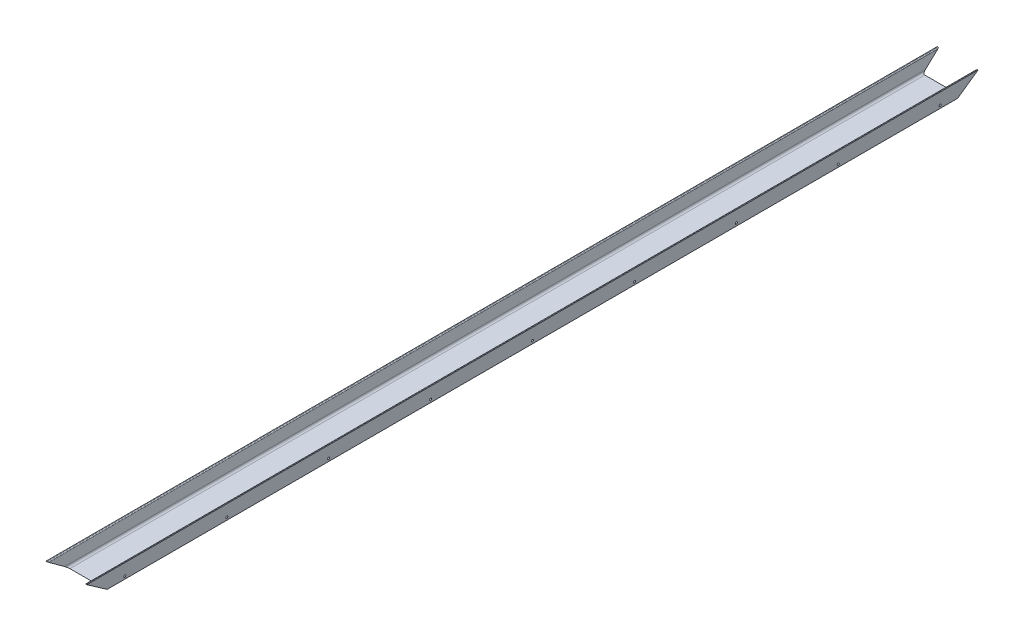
ISO-10303-21;
HEADER;
FILE_DESCRIPTION(('STEP AP214'),'2;1');
FILE_NAME('part.step','',(''),(''),'','','');
FILE_SCHEMA(('AUTOMOTIVE_DESIGN { 1 0 10303 214 1 1 1 1 }'));
ENDSEC;
DATA;
#1=APPLICATION_CONTEXT('core data for automotive mechanical design processes');
#2=APPLICATION_PROTOCOL_DEFINITION('international standard','automotive_design',2000,#1);
#3=PRODUCT_CONTEXT('',#1,'mechanical');
#4=PRODUCT('Part','Part','',(#3));
#5=PRODUCT_RELATED_PRODUCT_CATEGORY('part','',(#4));
#6=PRODUCT_DEFINITION_FORMATION('','',#4);
#7=PRODUCT_DEFINITION_CONTEXT('part definition',#1,'design');
#8=PRODUCT_DEFINITION('design','',#6,#7);
#9=PRODUCT_DEFINITION_SHAPE('','',#8);
#10=(LENGTH_UNIT() NAMED_UNIT(*) SI_UNIT(.MILLI.,.METRE.));
#11=(NAMED_UNIT(*) PLANE_ANGLE_UNIT() SI_UNIT($,.RADIAN.));
#12=(NAMED_UNIT(*) SI_UNIT($,.STERADIAN.) SOLID_ANGLE_UNIT());
#13=UNCERTAINTY_MEASURE_WITH_UNIT(LENGTH_MEASURE(1.E-05),#10,'distance_accuracy_value','');
#14=(GEOMETRIC_REPRESENTATION_CONTEXT(3) GLOBAL_UNCERTAINTY_ASSIGNED_CONTEXT((#13)) GLOBAL_UNIT_ASSIGNED_CONTEXT((#10,
#11,#12)) REPRESENTATION_CONTEXT('',''));
#15=CARTESIAN_POINT('',(0.,0.,0.));
#16=DIRECTION('',(0.,0.,1.));
#17=DIRECTION('',(1.,0.,0.));
#18=AXIS2_PLACEMENT_3D('',#15,#16,#17);
#19=CARTESIAN_POINT('',(63.5,2.21709065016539E-13,1388.364));
#20=DIRECTION('',(-1.,0.,0.));
#21=DIRECTION('',(0.,-1.,0.));
#22=AXIS2_PLACEMENT_3D('',#19,#20,#21);
#23=PLANE('',#22);
#24=CARTESIAN_POINT('',(63.5,8.38200000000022,-1270.46551676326));
#25=DIRECTION('',(1.,0.,0.));
#26=DIRECTION('',(0.,0.,-1.));
#27=AXIS2_PLACEMENT_3D('',#24,#25,#26);
#28=CIRCLE('',#27,3.175);
#29=CARTESIAN_POINT('',(63.5,8.38200000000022,-1273.64051676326));
#30=VERTEX_POINT('',#29);
#31=EDGE_CURVE('E241',#30,#30,#28,.T.);
#32=ORIENTED_EDGE('',*,*,#31,.F.);
#33=EDGE_LOOP('',(#32));
#34=FACE_BOUND('',#33,.T.);
#35=CARTESIAN_POINT('',(63.5,8.38200000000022,-952.965516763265));
#36=DIRECTION('',(1.,0.,0.));
#37=DIRECTION('',(0.,0.,-1.));
#38=AXIS2_PLACEMENT_3D('',#35,#36,#37);
#39=CIRCLE('',#38,3.175);
#40=CARTESIAN_POINT('',(63.5,8.38200000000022,-956.140516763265));
#41=VERTEX_POINT('',#40);
#42=EDGE_CURVE('E240',#41,#41,#39,.T.);
#43=ORIENTED_EDGE('',*,*,#42,.F.);
#44=EDGE_LOOP('',(#43));
#45=FACE_BOUND('',#44,.T.);
#46=CARTESIAN_POINT('',(63.5,8.38200000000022,-635.465516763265));
#47=DIRECTION('',(1.,0.,0.));
#48=DIRECTION('',(0.,0.,-1.));
#49=AXIS2_PLACEMENT_3D('',#46,#47,#48);
#50=CIRCLE('',#49,3.175);
#51=CARTESIAN_POINT('',(63.5,8.38200000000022,-638.640516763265));
#52=VERTEX_POINT('',#51);
#53=EDGE_CURVE('E350',#52,#52,#50,.T.);
#54=ORIENTED_EDGE('',*,*,#53,.F.);
#55=EDGE_LOOP('',(#54));
#56=FACE_BOUND('',#55,.T.);
#57=CARTESIAN_POINT('',(63.5,8.38200000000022,-317.965516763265));
#58=DIRECTION('',(1.,0.,0.));
#59=DIRECTION('',(0.,0.,-1.));
#60=AXIS2_PLACEMENT_3D('',#57,#58,#59);
#61=CIRCLE('',#60,3.175);
#62=CARTESIAN_POINT('',(63.5,8.38200000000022,-321.140516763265));
#63=VERTEX_POINT('',#62);
#64=EDGE_CURVE('E354',#63,#63,#61,.T.);
#65=ORIENTED_EDGE('',*,*,#64,.F.);
#66=EDGE_LOOP('',(#65));
#67=FACE_BOUND('',#66,.T.);
#68=CARTESIAN_POINT('',(63.5,8.38200000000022,-0.465516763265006));
#69=DIRECTION('',(1.,0.,0.));
#70=DIRECTION('',(0.,0.,-1.));
#71=AXIS2_PLACEMENT_3D('',#68,#69,#70);
#72=CIRCLE('',#71,3.175);
#73=CARTESIAN_POINT('',(63.5,8.38200000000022,-3.640516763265));
#74=VERTEX_POINT('',#73);
#75=EDGE_CURVE('E358',#74,#74,#72,.T.);
#76=ORIENTED_EDGE('',*,*,#75,.F.);
#77=EDGE_LOOP('',(#76));
#78=FACE_BOUND('',#77,.T.);
#79=CARTESIAN_POINT('',(63.5,8.38200000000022,317.034483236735));
#80=DIRECTION('',(1.,0.,0.));
#81=DIRECTION('',(0.,0.,-1.));
#82=AXIS2_PLACEMENT_3D('',#79,#80,#81);
#83=CIRCLE('',#82,3.175);
#84=CARTESIAN_POINT('',(63.5,8.38200000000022,313.859483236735));
#85=VERTEX_POINT('',#84);
#86=EDGE_CURVE('E362',#85,#85,#83,.T.);
#87=ORIENTED_EDGE('',*,*,#86,.F.);
#88=EDGE_LOOP('',(#87));
#89=FACE_BOUND('',#88,.T.);
#90=CARTESIAN_POINT('',(63.5,8.38200000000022,634.534483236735));
#91=DIRECTION('',(1.,0.,0.));
#92=DIRECTION('',(0.,0.,-1.));
#93=AXIS2_PLACEMENT_3D('',#90,#91,#92);
#94=CIRCLE('',#93,3.175);
#95=CARTESIAN_POINT('',(63.5,8.38200000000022,631.359483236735));
#96=VERTEX_POINT('',#95);
#97=EDGE_CURVE('E366',#96,#96,#94,.T.);
#98=ORIENTED_EDGE('',*,*,#97,.F.);
#99=EDGE_LOOP('',(#98));
#100=FACE_BOUND('',#99,.T.);
#101=CARTESIAN_POINT('',(63.5,8.38200000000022,952.034483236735));
#102=DIRECTION('',(1.,0.,0.));
#103=DIRECTION('',(0.,0.,-1.));
#104=AXIS2_PLACEMENT_3D('',#101,#102,#103);
#105=CIRCLE('',#104,3.175);
#106=CARTESIAN_POINT('',(63.5,8.38200000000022,948.859483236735));
#107=VERTEX_POINT('',#106);
#108=EDGE_CURVE('E370',#107,#107,#105,.T.);
#109=ORIENTED_EDGE('',*,*,#108,.F.);
#110=EDGE_LOOP('',(#109));
#111=FACE_BOUND('',#110,.T.);
#112=CARTESIAN_POINT('',(63.5,8.38200000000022,1269.53448323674));
#113=DIRECTION('',(1.,0.,0.));
#114=DIRECTION('',(0.,0.,-1.));
#115=AXIS2_PLACEMENT_3D('',#112,#113,#114);
#116=CIRCLE('',#115,3.175);
#117=CARTESIAN_POINT('',(63.5,8.38200000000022,1266.35948323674));
#118=VERTEX_POINT('',#117);
#119=EDGE_CURVE('E374',#118,#118,#116,.T.);
#120=ORIENTED_EDGE('',*,*,#119,.F.);
#121=EDGE_LOOP('',(#120));
#122=FACE_BOUND('',#121,.T.);
#123=DIRECTION('',(0.,0.,-1.));
#124=VECTOR('',#123,1.);
#125=CARTESIAN_POINT('',(63.5,2.21709065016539E-13,1388.364));
#126=LINE('',#125,#124);
#127=CARTESIAN_POINT('',(63.5,0.,1324.88282110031));
#128=VERTEX_POINT('',#127);
#129=CARTESIAN_POINT('',(63.5,0.,-1324.88282110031));
#130=VERTEX_POINT('',#129);
#131=EDGE_CURVE('E379',#128,#130,#126,.T.);
#132=ORIENTED_EDGE('',*,*,#131,.T.);
#133=DIRECTION('',(0.,-0.573576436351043,0.819152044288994));
#134=VECTOR('',#133,1.);
#135=CARTESIAN_POINT('',(63.5,44.4500000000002,-1388.364));
#136=LINE('',#135,#134);
#137=CARTESIAN_POINT('',(63.5,44.4500000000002,-1388.364));
#138=VERTEX_POINT('',#137);
#139=EDGE_CURVE('E381',#138,#130,#136,.T.);
#140=ORIENTED_EDGE('',*,*,#139,.F.);
#141=DIRECTION('',(0.,0.,-1.));
#142=VECTOR('',#141,1.);
#143=CARTESIAN_POINT('',(63.4999999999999,44.4500000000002,1388.364));
#144=LINE('',#143,#142);
#145=CARTESIAN_POINT('',(63.5,44.4500000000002,1388.364));
#146=VERTEX_POINT('',#145);
#147=EDGE_CURVE('E267',#146,#138,#144,.T.);
#148=ORIENTED_EDGE('',*,*,#147,.F.);
#149=DIRECTION('',(0.,0.573576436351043,0.819152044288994));
#150=VECTOR('',#149,1.);
#151=CARTESIAN_POINT('',(63.5,44.4500000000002,1388.364));
#152=LINE('',#151,#150);
#153=EDGE_CURVE('E382',#128,#146,#152,.T.);
#154=ORIENTED_EDGE('',*,*,#153,.F.);
#155=EDGE_LOOP('',(#132,#140,#148,#154));
#156=FACE_BOUND('',#155,.T.);
#157=ADVANCED_FACE('F80',(#34,#45,#56,#67,#78,#89,#100,#111,#122,#156),#23,.F.);
#158=CARTESIAN_POINT('',(63.4999999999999,44.4500000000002,1388.364));
#159=DIRECTION('',(0.,-1.,0.));
#160=DIRECTION('',(1.,0.,0.));
#161=AXIS2_PLACEMENT_3D('',#158,#159,#160);
#162=PLANE('',#161);
#163=DIRECTION('',(-1.,0.,0.));
#164=VECTOR('',#163,1.);
#165=CARTESIAN_POINT('',(63.4999999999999,44.4500000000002,-1388.364));
#166=LINE('',#165,#164);
#167=CARTESIAN_POINT('',(61.0412799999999,44.4500000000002,-1388.364));
#168=VERTEX_POINT('',#167);
#169=EDGE_CURVE('E462',#138,#168,#166,.T.);
#170=ORIENTED_EDGE('',*,*,#169,.T.);
#171=DIRECTION('',(0.,0.,-1.));
#172=VECTOR('',#171,1.);
#173=CARTESIAN_POINT('',(61.0412799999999,44.4500000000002,1388.364));
#174=LINE('',#173,#172);
#175=CARTESIAN_POINT('',(61.0412799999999,44.4500000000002,1388.364));
#176=VERTEX_POINT('',#175);
#177=EDGE_CURVE('E263',#176,#168,#174,.T.);
#178=ORIENTED_EDGE('',*,*,#177,.F.);
#179=DIRECTION('',(-1.,0.,0.));
#180=VECTOR('',#179,1.);
#181=CARTESIAN_POINT('',(63.4999999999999,44.4500000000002,1388.364));
#182=LINE('',#181,#180);
#183=EDGE_CURVE('E393',#146,#176,#182,.T.);
#184=ORIENTED_EDGE('',*,*,#183,.F.);
#185=ORIENTED_EDGE('',*,*,#147,.T.);
#186=EDGE_LOOP('',(#170,#178,#184,#185));
#187=FACE_BOUND('',#186,.T.);
#188=ADVANCED_FACE('F334',(#187),#162,.F.);
#189=CARTESIAN_POINT('',(61.0412799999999,41.6560000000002,1388.364));
#190=DIRECTION('',(0.,0.,-1.));
#191=DIRECTION('',(-1.,0.,0.));
#192=AXIS2_PLACEMENT_3D('',#189,#190,#191);
#193=CYLINDRICAL_SURFACE('',#192,2.79399999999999);
#194=ORIENTED_EDGE('',*,*,#177,.T.);
#195=CARTESIAN_POINT('',(61.0412799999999,41.6560000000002,-1384.37375446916));
#196=DIRECTION('',(0.,0.819152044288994,0.573576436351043));
#197=DIRECTION('',(0.,0.573576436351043,-0.819152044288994));
#198=AXIS2_PLACEMENT_3D('',#195,#196,#197);
#199=ELLIPSE('',#198,4.87119034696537,2.79399999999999);
#200=CARTESIAN_POINT('',(58.2853008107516,42.1153633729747,-1385.02979335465));
#201=VERTEX_POINT('',#200);
#202=EDGE_CURVE('E431',#168,#201,#199,.T.);
#203=ORIENTED_EDGE('',*,*,#202,.T.);
#204=DIRECTION('',(0.,0.,-1.));
#205=VECTOR('',#204,1.);
#206=CARTESIAN_POINT('',(58.2853008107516,42.1153633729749,1388.364));
#207=LINE('',#206,#205);
#208=CARTESIAN_POINT('',(58.2853008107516,42.1153633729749,1385.02979335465));
#209=VERTEX_POINT('',#208);
#210=EDGE_CURVE('E257',#209,#201,#207,.T.);
#211=ORIENTED_EDGE('',*,*,#210,.F.);
#212=CARTESIAN_POINT('',(61.0412799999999,41.6560000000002,1384.37375446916));
#213=DIRECTION('',(0.,0.819152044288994,-0.573576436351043));
#214=DIRECTION('',(0.,-0.573576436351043,-0.819152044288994));
#215=AXIS2_PLACEMENT_3D('',#212,#213,#214);
#216=ELLIPSE('',#215,4.87119034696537,2.79399999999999);
#217=EDGE_CURVE('E459',#209,#176,#216,.T.);
#218=ORIENTED_EDGE('',*,*,#217,.T.);
#219=EDGE_LOOP('',(#194,#203,#211,#218));
#220=FACE_BOUND('',#219,.T.);
#221=ADVANCED_FACE('F339',(#220),#193,.T.);
#222=CARTESIAN_POINT('',(53.0958535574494,10.9809511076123,1388.364));
#223=DIRECTION('',(0.986391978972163,-0.164410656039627,0.));
#224=DIRECTION('',(0.164410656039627,0.986391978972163,0.));
#225=AXIS2_PLACEMENT_3D('',#222,#223,#224);
#226=PLANE('',#225);
#227=DIRECTION('',(0.,0.,-1.));
#228=VECTOR('',#227,1.);
#229=CARTESIAN_POINT('',(53.0958535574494,10.9809511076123,1388.364));
#230=LINE('',#229,#228);
#231=CARTESIAN_POINT('',(53.0958535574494,10.9809511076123,-1272.28927062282));
#232=VERTEX_POINT('',#231);
#233=CARTESIAN_POINT('',(53.0958535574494,10.9809511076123,-1340.56524453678));
#234=VERTEX_POINT('',#233);
#235=EDGE_CURVE('E238',#232,#234,#230,.T.);
#236=ORIENTED_EDGE('',*,*,#235,.F.);
#237=CARTESIAN_POINT('',(52.662663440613,8.38200000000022,-1270.46551676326));
#238=DIRECTION('',(0.986391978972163,-0.164410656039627,0.));
#239=DIRECTION('',(0.164410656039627,0.986391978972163,0.));
#240=AXIS2_PLACEMENT_3D('',#237,#238,#239);
#241=ELLIPSE('',#240,3.2188015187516,3.175);
#242=CARTESIAN_POINT('',(53.0958535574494,10.9809511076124,-1268.64176290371));
#243=VERTEX_POINT('',#242);
#244=EDGE_CURVE('E102',#232,#243,#241,.T.);
#245=ORIENTED_EDGE('',*,*,#244,.T.);
#246=CARTESIAN_POINT('',(53.0958535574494,10.9809511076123,-954.78927062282));
#247=VERTEX_POINT('',#246);
#248=EDGE_CURVE('E236',#247,#243,#230,.T.);
#249=ORIENTED_EDGE('',*,*,#248,.F.);
#250=CARTESIAN_POINT('',(52.662663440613,8.38200000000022,-952.965516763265));
#251=DIRECTION('',(0.986391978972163,-0.164410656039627,0.));
#252=DIRECTION('',(0.164410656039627,0.986391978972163,0.));
#253=AXIS2_PLACEMENT_3D('',#250,#251,#252);
#254=ELLIPSE('',#253,3.2188015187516,3.175);
#255=CARTESIAN_POINT('',(53.0958535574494,10.9809511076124,-951.14176290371));
#256=VERTEX_POINT('',#255);
#257=EDGE_CURVE('E108',#247,#256,#254,.T.);
#258=ORIENTED_EDGE('',*,*,#257,.T.);
#259=CARTESIAN_POINT('',(53.0958535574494,10.9809511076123,-637.28927062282));
#260=VERTEX_POINT('',#259);
#261=EDGE_CURVE('E246',#260,#256,#230,.T.);
#262=ORIENTED_EDGE('',*,*,#261,.F.);
#263=CARTESIAN_POINT('',(52.662663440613,8.38200000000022,-635.465516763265));
#264=DIRECTION('',(0.986391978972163,-0.164410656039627,0.));
#265=DIRECTION('',(0.164410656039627,0.986391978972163,0.));
#266=AXIS2_PLACEMENT_3D('',#263,#264,#265);
#267=ELLIPSE('',#266,3.2188015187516,3.175);
#268=CARTESIAN_POINT('',(53.0958535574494,10.9809511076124,-633.64176290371));
#269=VERTEX_POINT('',#268);
#270=EDGE_CURVE('E524',#260,#269,#267,.T.);
#271=ORIENTED_EDGE('',*,*,#270,.T.);
#272=CARTESIAN_POINT('',(53.0958535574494,10.9809511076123,-319.78927062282));
#273=VERTEX_POINT('',#272);
#274=EDGE_CURVE('E250',#273,#269,#230,.T.);
#275=ORIENTED_EDGE('',*,*,#274,.F.);
#276=CARTESIAN_POINT('',(52.662663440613,8.38200000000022,-317.965516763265));
#277=DIRECTION('',(0.986391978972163,-0.164410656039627,0.));
#278=DIRECTION('',(0.164410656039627,0.986391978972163,0.));
#279=AXIS2_PLACEMENT_3D('',#276,#277,#278);
#280=ELLIPSE('',#279,3.2188015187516,3.175);
#281=CARTESIAN_POINT('',(53.0958535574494,10.9809511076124,-316.14176290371));
#282=VERTEX_POINT('',#281);
#283=EDGE_CURVE('E523',#273,#282,#280,.T.);
#284=ORIENTED_EDGE('',*,*,#283,.T.);
#285=CARTESIAN_POINT('',(53.0958535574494,10.9809511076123,-2.28927062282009));
#286=VERTEX_POINT('',#285);
#287=EDGE_CURVE('E509',#286,#282,#230,.T.);
#288=ORIENTED_EDGE('',*,*,#287,.F.);
#289=CARTESIAN_POINT('',(52.662663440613,8.38200000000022,-0.465516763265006));
#290=DIRECTION('',(0.986391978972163,-0.164410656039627,0.));
#291=DIRECTION('',(0.164410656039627,0.986391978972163,0.));
#292=AXIS2_PLACEMENT_3D('',#289,#290,#291);
#293=ELLIPSE('',#292,3.2188015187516,3.175);
#294=CARTESIAN_POINT('',(53.0958535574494,10.9809511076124,1.35823709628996));
#295=VERTEX_POINT('',#294);
#296=EDGE_CURVE('E533',#286,#295,#293,.T.);
#297=ORIENTED_EDGE('',*,*,#296,.T.);
#298=CARTESIAN_POINT('',(53.0958535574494,10.9809511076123,315.21072937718));
#299=VERTEX_POINT('',#298);
#300=EDGE_CURVE('E505',#299,#295,#230,.T.);
#301=ORIENTED_EDGE('',*,*,#300,.F.);
#302=CARTESIAN_POINT('',(52.662663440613,8.38200000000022,317.034483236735));
#303=DIRECTION('',(0.986391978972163,-0.164410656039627,0.));
#304=DIRECTION('',(0.164410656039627,0.986391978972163,0.));
#305=AXIS2_PLACEMENT_3D('',#302,#303,#304);
#306=ELLIPSE('',#305,3.2188015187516,3.175);
#307=CARTESIAN_POINT('',(53.0958535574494,10.9809511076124,318.85823709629));
#308=VERTEX_POINT('',#307);
#309=EDGE_CURVE('E537',#299,#308,#306,.T.);
#310=ORIENTED_EDGE('',*,*,#309,.T.);
#311=CARTESIAN_POINT('',(53.0958535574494,10.9809511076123,632.71072937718));
#312=VERTEX_POINT('',#311);
#313=EDGE_CURVE('E502',#312,#308,#230,.T.);
#314=ORIENTED_EDGE('',*,*,#313,.F.);
#315=CARTESIAN_POINT('',(52.662663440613,8.38200000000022,634.534483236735));
#316=DIRECTION('',(0.986391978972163,-0.164410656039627,0.));
#317=DIRECTION('',(0.164410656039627,0.986391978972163,0.));
#318=AXIS2_PLACEMENT_3D('',#315,#316,#317);
#319=ELLIPSE('',#318,3.2188015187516,3.175);
#320=CARTESIAN_POINT('',(53.0958535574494,10.9809511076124,636.35823709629));
#321=VERTEX_POINT('',#320);
#322=EDGE_CURVE('E541',#312,#321,#319,.T.);
#323=ORIENTED_EDGE('',*,*,#322,.T.);
#324=CARTESIAN_POINT('',(53.0958535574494,10.9809511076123,950.21072937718));
#325=VERTEX_POINT('',#324);
#326=EDGE_CURVE('E500',#325,#321,#230,.T.);
#327=ORIENTED_EDGE('',*,*,#326,.F.);
#328=CARTESIAN_POINT('',(52.662663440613,8.38200000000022,952.034483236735));
#329=DIRECTION('',(0.986391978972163,-0.164410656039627,0.));
#330=DIRECTION('',(0.164410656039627,0.986391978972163,0.));
#331=AXIS2_PLACEMENT_3D('',#328,#329,#330);
#332=ELLIPSE('',#331,3.2188015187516,3.175);
#333=CARTESIAN_POINT('',(53.0958535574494,10.9809511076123,953.85823709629));
#334=VERTEX_POINT('',#333);
#335=EDGE_CURVE('E499',#325,#334,#332,.T.);
#336=ORIENTED_EDGE('',*,*,#335,.T.);
#337=CARTESIAN_POINT('',(53.0958535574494,10.9809511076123,1267.71072937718));
#338=VERTEX_POINT('',#337);
#339=EDGE_CURVE('E258',#338,#334,#230,.T.);
#340=ORIENTED_EDGE('',*,*,#339,.F.);
#341=CARTESIAN_POINT('',(52.662663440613,8.38200000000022,1269.53448323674));
#342=DIRECTION('',(0.986391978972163,-0.164410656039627,0.));
#343=DIRECTION('',(0.164410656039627,0.986391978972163,0.));
#344=AXIS2_PLACEMENT_3D('',#341,#342,#343);
#345=ELLIPSE('',#344,3.2188015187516,3.175);
#346=CARTESIAN_POINT('',(53.0958535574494,10.9809511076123,1271.35823709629));
#347=VERTEX_POINT('',#346);
#348=EDGE_CURVE('E493',#338,#347,#345,.T.);
#349=ORIENTED_EDGE('',*,*,#348,.T.);
#350=CARTESIAN_POINT('',(53.0958535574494,10.9809511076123,1340.56524453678));
#351=VERTEX_POINT('',#350);
#352=EDGE_CURVE('E253',#351,#347,#230,.T.);
#353=ORIENTED_EDGE('',*,*,#352,.F.);
#354=DIRECTION('',(0.0951691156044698,0.570973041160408,0.815434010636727));
#355=VECTOR('',#354,1.);
#356=CARTESIAN_POINT('',(56.8052345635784,33.2356136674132,1372.34819651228));
#357=LINE('',#356,#355);
#358=EDGE_CURVE('E456',#351,#209,#357,.T.);
#359=ORIENTED_EDGE('',*,*,#358,.T.);
#360=ORIENTED_EDGE('',*,*,#210,.T.);
#361=DIRECTION('',(-0.0951691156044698,-0.570973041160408,0.815434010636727));
#362=VECTOR('',#361,1.);
#363=CARTESIAN_POINT('',(-158.680336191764,-1259.58349974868,473.988843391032));
#364=LINE('',#363,#362);
#365=EDGE_CURVE('E429',#201,#234,#364,.T.);
#366=ORIENTED_EDGE('',*,*,#365,.T.);
#367=EDGE_LOOP('',(#236,#245,#249,#258,#262,#271,#275,#284,#288,#297,#301,#310,#314,#323,#327,
#336,#340,#349,#353,#359,#360,#366));
#368=FACE_BOUND('',#367,.T.);
#369=ADVANCED_FACE('F235',(#368),#226,.F.);
#370=CARTESIAN_POINT('',(45.8300902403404,12.1920000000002,1388.364));
#371=DIRECTION('',(0.,0.,-1.));
#372=DIRECTION('',(-1.,0.,0.));
#373=AXIS2_PLACEMENT_3D('',#370,#371,#372);
#374=CYLINDRICAL_SURFACE('',#373,7.36600000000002);
#375=ORIENTED_EDGE('',*,*,#248,.T.);
#376=CARTESIAN_POINT('',(53.0958535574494,10.9809511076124,-1268.64176290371));
#377=CARTESIAN_POINT('',(53.0876748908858,10.9318835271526,-1268.57181538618));
#378=CARTESIAN_POINT('',(53.0785203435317,10.8800231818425,-1268.50393824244));
#379=CARTESIAN_POINT('',(53.0579765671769,10.7711967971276,-1268.37276662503));
#380=CARTESIAN_POINT('',(53.0465872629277,10.7142305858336,-1268.30947230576));
#381=CARTESIAN_POINT('',(53.021312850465,10.5957754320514,-1268.18801531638));
#382=CARTESIAN_POINT('',(53.0074319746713,10.5342942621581,-1268.12984418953));
#383=CARTESIAN_POINT('',(52.9769092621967,10.4072876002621,-1268.01889806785));
#384=CARTESIAN_POINT('',(52.9602675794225,10.3417623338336,-1267.96612277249));
#385=CARTESIAN_POINT('',(52.9239900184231,10.2072077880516,-1267.8662343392));
#386=CARTESIAN_POINT('',(52.9043512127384,10.1381751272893,-1267.81912681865));
#387=CARTESIAN_POINT('',(52.8619214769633,9.99729729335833,-1267.73085906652));
#388=CARTESIAN_POINT('',(52.839129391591,9.92545109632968,-1267.68970102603));
#389=CARTESIAN_POINT('',(52.7903118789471,9.77970535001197,-1267.61353552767));
#390=CARTESIAN_POINT('',(52.7642890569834,9.70580749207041,-1267.57852316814));
#391=CARTESIAN_POINT('',(52.7089623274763,9.55658180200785,-1267.51465536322));
#392=CARTESIAN_POINT('',(52.6796571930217,9.48125344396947,-1267.4858022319));
#393=CARTESIAN_POINT('',(52.5866834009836,9.25377818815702,-1267.40835144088));
#394=CARTESIAN_POINT('',(52.518041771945,9.10040105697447,-1267.36899590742));
#395=CARTESIAN_POINT('',(52.3684978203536,8.79551380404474,-1267.31373634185));
#396=CARTESIAN_POINT('',(52.2875879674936,8.64400489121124,-1267.29784677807));
#397=CARTESIAN_POINT('',(52.1067910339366,8.33241285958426,-1267.28672493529));
#398=CARTESIAN_POINT('',(52.0058312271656,8.17288312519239,-1267.29359916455));
#399=CARTESIAN_POINT('',(51.7932600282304,7.86374188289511,-1267.32923131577));
#400=CARTESIAN_POINT('',(51.6816440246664,7.71413471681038,-1267.35799874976));
#401=CARTESIAN_POINT('',(51.4769604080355,7.46009428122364,-1267.42516391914));
#402=CARTESIAN_POINT('',(51.3856001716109,7.35323530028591,-1267.4597769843));
#403=CARTESIAN_POINT('',(51.1988036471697,7.14677924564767,-1267.53856155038));
#404=CARTESIAN_POINT('',(51.1033655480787,7.04718545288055,-1267.5827373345));
#405=CARTESIAN_POINT('',(50.9090461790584,6.85525300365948,-1267.67961330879));
#406=CARTESIAN_POINT('',(50.8101564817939,6.76293420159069,-1267.73233570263));
#407=CARTESIAN_POINT('',(50.6099647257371,6.5858774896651,-1267.84528874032));
#408=CARTESIAN_POINT('',(50.5086630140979,6.50113849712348,-1267.9055183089));
#409=CARTESIAN_POINT('',(50.3019011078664,6.3371994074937,-1268.03435468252));
#410=CARTESIAN_POINT('',(50.1963996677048,6.25818379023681,-1268.10312940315));
#411=CARTESIAN_POINT('',(49.9844618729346,6.10792045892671,-1268.24740055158));
#412=CARTESIAN_POINT('',(49.8780254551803,6.03667327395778,-1268.32289743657));
#413=CARTESIAN_POINT('',(49.6655311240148,5.90207841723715,-1268.48024572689));
#414=CARTESIAN_POINT('',(49.5594731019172,5.83870589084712,-1268.56207574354));
#415=CARTESIAN_POINT('',(49.3486709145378,5.71958365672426,-1268.73260264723));
#416=CARTESIAN_POINT('',(49.2439261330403,5.66383024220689,-1268.82129616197));
#417=CARTESIAN_POINT('',(49.0530180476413,5.56777513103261,-1268.99278982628));
#418=CARTESIAN_POINT('',(48.96641162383,5.52640891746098,-1269.07449887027));
#419=CARTESIAN_POINT('',(48.797151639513,5.44936441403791,-1269.24522609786));
#420=CARTESIAN_POINT('',(48.7145134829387,5.41370720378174,-1269.33426961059));
#421=CARTESIAN_POINT('',(48.5960729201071,5.3649092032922,-1269.47541862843));
#422=CARTESIAN_POINT('',(48.557250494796,5.349328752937,-1269.52411482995));
#423=CARTESIAN_POINT('',(48.4825731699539,5.32003442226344,-1269.62425159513));
#424=CARTESIAN_POINT('',(48.4467200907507,5.30632168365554,-1269.6756938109));
#425=CARTESIAN_POINT('',(48.3456982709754,5.26851050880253,-1269.83422337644));
#426=CARTESIAN_POINT('',(48.2863376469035,5.24744574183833,-1269.94632286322));
#427=CARTESIAN_POINT('',(48.2218065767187,5.22506464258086,-1270.12242991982));
#428=CARTESIAN_POINT('',(48.2044870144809,5.21916896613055,-1270.18133084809));
#429=CARTESIAN_POINT('',(48.1794075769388,5.21067935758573,-1270.30134724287));
#430=CARTESIAN_POINT('',(48.1716294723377,5.2080791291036,-1270.36245825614));
#431=CARTESIAN_POINT('',(48.1668125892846,5.20646516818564,-1270.48543496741));
#432=CARTESIAN_POINT('',(48.1698205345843,5.20746703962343,-1270.54730278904));
#433=CARTESIAN_POINT('',(48.1861735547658,5.21296756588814,-1270.66952460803));
#434=CARTESIAN_POINT('',(48.199535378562,5.21747188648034,-1270.72987598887));
#435=CARTESIAN_POINT('',(48.2409776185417,5.23166962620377,-1270.86862313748));
#436=CARTESIAN_POINT('',(48.2726033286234,5.24263908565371,-1270.94579928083));
#437=CARTESIAN_POINT('',(48.3462151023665,5.26895183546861,-1271.09423422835));
#438=CARTESIAN_POINT('',(48.3882337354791,5.28430889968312,-1271.16547347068));
#439=CARTESIAN_POINT('',(48.4798807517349,5.31893462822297,-1271.30425498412));
#440=CARTESIAN_POINT('',(48.5296647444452,5.33828672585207,-1271.37167105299));
#441=CARTESIAN_POINT('',(48.6336586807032,5.38016382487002,-1271.50199776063));
#442=CARTESIAN_POINT('',(48.6878733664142,5.40269224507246,-1271.56490343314));
#443=CARTESIAN_POINT('',(48.7993044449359,5.45067856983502,-1271.68711321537));
#444=CARTESIAN_POINT('',(48.8565283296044,5.47614399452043,-1271.74640745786));
#445=CARTESIAN_POINT('',(48.9728919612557,5.52980292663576,-1271.8618120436));
#446=CARTESIAN_POINT('',(49.0320323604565,5.55799736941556,-1271.91792128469));
#447=CARTESIAN_POINT('',(49.2139615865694,5.64785116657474,-1272.08454771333));
#448=CARTESIAN_POINT('',(49.3387163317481,5.71370764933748,-1272.19068636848));
#449=CARTESIAN_POINT('',(49.5899883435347,5.85622273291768,-1272.39331044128));
#450=CARTESIAN_POINT('',(49.7165070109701,5.93289041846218,-1272.48978762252));
#451=CARTESIAN_POINT('',(49.96914398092,6.09701523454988,-1272.67336721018));
#452=CARTESIAN_POINT('',(50.095262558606,6.18446139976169,-1272.76047897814));
#453=CARTESIAN_POINT('',(50.3456848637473,6.3703393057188,-1272.92504098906));
#454=CARTESIAN_POINT('',(50.4699882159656,6.46877328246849,-1273.0024892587));
#455=CARTESIAN_POINT('',(50.7833402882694,6.73439014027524,-1273.1866647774));
#456=CARTESIAN_POINT('',(50.9702690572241,6.90953818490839,-1273.28596789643));
#457=CARTESIAN_POINT('',(51.2406622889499,7.19193234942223,-1273.41083710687));
#458=CARTESIAN_POINT('',(51.3290832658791,7.28928661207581,-1273.44843261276));
#459=CARTESIAN_POINT('',(51.5019512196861,7.49034746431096,-1273.51458167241));
#460=CARTESIAN_POINT('',(51.5863992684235,7.59405232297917,-1273.54313767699));
#461=CARTESIAN_POINT('',(51.7949196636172,7.86515716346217,-1273.60267298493));
#462=CARTESIAN_POINT('',(51.9157946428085,8.03674078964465,-1273.62665078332));
#463=CARTESIAN_POINT('',(52.0861402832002,8.30214955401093,-1273.64075253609));
#464=CARTESIAN_POINT('',(52.141114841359,8.39199688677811,-1273.64180486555));
#465=CARTESIAN_POINT('',(52.2470477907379,8.57376246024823,-1273.63602259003));
#466=CARTESIAN_POINT('',(52.2980082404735,8.66567960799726,-1273.62919205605));
#467=CARTESIAN_POINT('',(52.3960346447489,8.85171599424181,-1273.60698983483));
#468=CARTESIAN_POINT('',(52.4430580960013,8.94584793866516,-1273.59153605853));
#469=CARTESIAN_POINT('',(52.5323273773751,9.1344119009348,-1273.551579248));
#470=CARTESIAN_POINT('',(52.5745756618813,9.22884373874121,-1273.52708089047));
#471=CARTESIAN_POINT('',(52.6540998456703,9.41688416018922,-1273.46873623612));
#472=CARTESIAN_POINT('',(52.6913772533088,9.51049298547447,-1273.43489278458));
#473=CARTESIAN_POINT('',(52.7608904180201,9.69565466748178,-1273.3577458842));
#474=CARTESIAN_POINT('',(52.7931271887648,9.78720793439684,-1273.31444434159));
#475=CARTESIAN_POINT('',(52.8483011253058,9.95387056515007,-1273.22548585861));
#476=CARTESIAN_POINT('',(52.8719089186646,10.0294337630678,-1273.1810891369));
#477=CARTESIAN_POINT('',(52.9156345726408,10.177313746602,-1273.08567204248));
#478=CARTESIAN_POINT('',(52.9357528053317,10.2496308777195,-1273.03465237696));
#479=CARTESIAN_POINT('',(52.9726877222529,10.3901856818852,-1272.92634596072));
#480=CARTESIAN_POINT('',(52.9895076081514,10.4584272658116,-1272.86906537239));
#481=CARTESIAN_POINT('',(53.020131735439,10.5901785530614,-1272.74861439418));
#482=CARTESIAN_POINT('',(53.0339372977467,10.6536903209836,-1272.68544660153));
#483=CARTESIAN_POINT('',(53.0562089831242,10.7624682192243,-1272.56765610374));
#484=CARTESIAN_POINT('',(53.0651866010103,10.808748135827,-1272.5140604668));
#485=CARTESIAN_POINT('',(53.0816149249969,10.8976345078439,-1272.40387082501));
#486=CARTESIAN_POINT('',(53.0890687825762,10.9402484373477,-1272.34728331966));
#487=CARTESIAN_POINT('',(53.0958535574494,10.9809511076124,-1272.28927062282));
#488=B_SPLINE_CURVE_WITH_KNOTS('',3,(#376,#377,#378,#379,#380,#381,#382,#383,#384,#385,#386,
#387,#388,#389,#390,#391,#392,#393,#394,#395,#396,#397,#398,#399,#400,#401,#402,#403,#404,#405,
#406,#407,#408,#409,#410,#411,#412,#413,#414,#415,#416,#417,#418,#419,#420,#421,#422,#423,#424,
#425,#426,#427,#428,#429,#430,#431,#432,#433,#434,#435,#436,#437,#438,#439,#440,#441,#442,#443,
#444,#445,#446,#447,#448,#449,#450,#451,#452,#453,#454,#455,#456,#457,#458,#459,#460,#461,#462,
#463,#464,#465,#466,#467,#468,#469,#470,#471,#472,#473,#474,#475,#476,#477,#478,#479,#480,#481,
#482,#483,#484,#485,#486,#487),.UNSPECIFIED.,.F.,.F.,(4,2,2,2,2,2,2,2,2,2,2,2,2,2,2,2,2,2,2,2,2,
2,2,2,2,2,2,2,2,2,2,2,2,2,2,2,2,2,2,2,2,2,2,2,2,2,2,2,2,2,2,2,2,2,2,4),(0.,0.257425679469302,
0.514860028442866,0.771861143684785,1.02884793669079,1.28608736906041,1.54342129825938,
1.80054904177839,2.05777322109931,2.57312391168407,3.0887922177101,3.6534634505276,
4.21838015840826,4.6521855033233,5.08618555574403,5.52133174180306,5.95641567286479,
6.4020652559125,6.84774517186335,7.2919805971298,7.73599912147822,8.11385602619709,
8.49307744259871,8.68550832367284,8.87805631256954,9.25978996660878,9.44412678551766,
9.62811087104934,9.81289291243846,9.99797449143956,10.2489059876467,10.5006340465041,
10.7582770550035,11.0161995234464,11.2747977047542,11.5334848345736,12.0623441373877,
12.5916505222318,13.1204228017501,13.649302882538,14.470005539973,14.879930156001,
15.2897435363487,15.9206130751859,16.2363093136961,16.5518425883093,16.8704321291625,
17.1888571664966,17.5071853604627,17.825449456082,18.0973890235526,18.369299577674,
18.6409448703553,18.9124708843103,19.1264391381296,19.3399602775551),.UNSPECIFIED.);
#489=EDGE_CURVE('E13',#243,#232,#488,.T.);
#490=ORIENTED_EDGE('',*,*,#489,.T.);
#491=ORIENTED_EDGE('',*,*,#235,.T.);
#492=CARTESIAN_POINT('',(45.8300902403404,12.1920000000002,-1342.29480159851));
#493=DIRECTION('',(0.,0.819152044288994,0.573576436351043));
#494=DIRECTION('',(0.,0.573576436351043,-0.819152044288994));
#495=AXIS2_PLACEMENT_3D('',#492,#493,#494);
#496=ELLIPSE('',#495,12.8422290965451,7.36600000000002);
#497=CARTESIAN_POINT('',(45.8300902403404,4.82600000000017,-1331.77506338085));
#498=VERTEX_POINT('',#497);
#499=EDGE_CURVE('E428',#234,#498,#496,.F.);
#500=ORIENTED_EDGE('',*,*,#499,.T.);
#501=DIRECTION('',(0.,0.,-1.));
#502=VECTOR('',#501,1.);
#503=CARTESIAN_POINT('',(45.8300902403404,4.82600000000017,1388.364));
#504=LINE('',#503,#502);
#505=CARTESIAN_POINT('',(45.8300902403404,4.82600000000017,1331.77506338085));
#506=VERTEX_POINT('',#505);
#507=EDGE_CURVE('E252',#506,#498,#504,.T.);
#508=ORIENTED_EDGE('',*,*,#507,.F.);
#509=CARTESIAN_POINT('',(45.8300902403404,12.1920000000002,1342.29480159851));
#510=DIRECTION('',(0.,0.819152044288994,-0.573576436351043));
#511=DIRECTION('',(0.,-0.573576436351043,-0.819152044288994));
#512=AXIS2_PLACEMENT_3D('',#509,#510,#511);
#513=ELLIPSE('',#512,12.8422290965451,7.36600000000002);
#514=EDGE_CURVE('E425',#506,#351,#513,.F.);
#515=ORIENTED_EDGE('',*,*,#514,.T.);
#516=ORIENTED_EDGE('',*,*,#352,.T.);
#517=CARTESIAN_POINT('',(53.0958535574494,10.9809511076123,1271.35823709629));
#518=CARTESIAN_POINT('',(53.0876748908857,10.9318835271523,1271.42818461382));
#519=CARTESIAN_POINT('',(53.0785203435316,10.8800231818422,1271.49606175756));
#520=CARTESIAN_POINT('',(53.0579765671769,10.7711967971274,1271.62723337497));
#521=CARTESIAN_POINT('',(53.0465872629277,10.7142305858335,1271.69052769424));
#522=CARTESIAN_POINT('',(53.021312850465,10.5957754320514,1271.81198468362));
#523=CARTESIAN_POINT('',(53.0074319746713,10.5342942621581,1271.87015581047));
#524=CARTESIAN_POINT('',(52.9769092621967,10.4072876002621,1271.98110193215));
#525=CARTESIAN_POINT('',(52.9602675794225,10.3417623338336,1272.03387722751));
#526=CARTESIAN_POINT('',(52.9239900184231,10.2072077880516,1272.1337656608));
#527=CARTESIAN_POINT('',(52.9043512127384,10.1381751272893,1272.18087318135));
#528=CARTESIAN_POINT('',(52.8619214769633,9.99729729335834,1272.26914093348));
#529=CARTESIAN_POINT('',(52.839129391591,9.92545109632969,1272.31029897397));
#530=CARTESIAN_POINT('',(52.7903118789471,9.77970535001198,1272.38646447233));
#531=CARTESIAN_POINT('',(52.7642890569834,9.70580749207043,1272.42147683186));
#532=CARTESIAN_POINT('',(52.7089623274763,9.55658180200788,1272.48534463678));
#533=CARTESIAN_POINT('',(52.6796571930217,9.48125344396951,1272.5141977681));
#534=CARTESIAN_POINT('',(52.5866834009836,9.25377818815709,1272.59164855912));
#535=CARTESIAN_POINT('',(52.5180417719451,9.10040105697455,1272.63100409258));
#536=CARTESIAN_POINT('',(52.3684978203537,8.79551380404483,1272.68626365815));
#537=CARTESIAN_POINT('',(52.2875879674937,8.64400489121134,1272.70215322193));
#538=CARTESIAN_POINT('',(52.1067910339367,8.33241285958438,1272.71327506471));
#539=CARTESIAN_POINT('',(52.0058312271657,8.17288312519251,1272.70640083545));
#540=CARTESIAN_POINT('',(51.7932600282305,7.86374188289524,1272.67076868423));
#541=CARTESIAN_POINT('',(51.6816440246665,7.71413471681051,1272.64200125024));
#542=CARTESIAN_POINT('',(51.4769604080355,7.46009428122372,1272.57483608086));
#543=CARTESIAN_POINT('',(51.385600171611,7.35323530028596,1272.5402230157));
#544=CARTESIAN_POINT('',(51.1988036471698,7.14677924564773,1272.46143844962));
#545=CARTESIAN_POINT('',(51.1033655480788,7.04718545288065,1272.4172626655));
#546=CARTESIAN_POINT('',(50.9090461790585,6.8552530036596,1272.32038669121));
#547=CARTESIAN_POINT('',(50.810156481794,6.76293420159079,1272.26766429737));
#548=CARTESIAN_POINT('',(50.6099647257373,6.5858774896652,1272.15471125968));
#549=CARTESIAN_POINT('',(50.508663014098,6.50113849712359,1272.0944816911));
#550=CARTESIAN_POINT('',(50.3019011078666,6.33719940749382,1271.96564531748));
#551=CARTESIAN_POINT('',(50.196399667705,6.25818379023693,1271.89687059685));
#552=CARTESIAN_POINT('',(49.9844618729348,6.10792045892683,1271.75259944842));
#553=CARTESIAN_POINT('',(49.8780254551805,6.03667327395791,1271.67710256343));
#554=CARTESIAN_POINT('',(49.665531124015,5.90207841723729,1271.51975427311));
#555=CARTESIAN_POINT('',(49.5594731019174,5.83870589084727,1271.43792425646));
#556=CARTESIAN_POINT('',(49.3486709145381,5.71958365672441,1271.26739735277));
#557=CARTESIAN_POINT('',(49.2439261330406,5.66383024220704,1271.17870383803));
#558=CARTESIAN_POINT('',(49.0530180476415,5.5677751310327,1271.00721017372));
#559=CARTESIAN_POINT('',(48.9664116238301,5.52640891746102,1270.92550112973));
#560=CARTESIAN_POINT('',(48.7971516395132,5.44936441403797,1270.75477390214));
#561=CARTESIAN_POINT('',(48.714513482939,5.41370720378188,1270.66573038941));
#562=CARTESIAN_POINT('',(48.5960729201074,5.36490920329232,1270.52458137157));
#563=CARTESIAN_POINT('',(48.5572504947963,5.34932875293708,1270.47588517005));
#564=CARTESIAN_POINT('',(48.4825731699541,5.32003442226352,1270.37574840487));
#565=CARTESIAN_POINT('',(48.4467200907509,5.30632168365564,1270.3243061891));
#566=CARTESIAN_POINT('',(48.3456982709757,5.26851050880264,1270.16577662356));
#567=CARTESIAN_POINT('',(48.2863376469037,5.2474457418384,1270.05367713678));
#568=CARTESIAN_POINT('',(48.2218065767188,5.22506464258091,1269.87757008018));
#569=CARTESIAN_POINT('',(48.2044870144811,5.21916896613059,1269.81866915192));
#570=CARTESIAN_POINT('',(48.1794075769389,5.21067935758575,1269.69865275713));
#571=CARTESIAN_POINT('',(48.1716294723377,5.20807912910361,1269.63754174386));
#572=CARTESIAN_POINT('',(48.1668125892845,5.20646516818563,1269.51456503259));
#573=CARTESIAN_POINT('',(48.1698205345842,5.20746703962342,1269.45269721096));
#574=CARTESIAN_POINT('',(48.1861735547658,5.21296756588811,1269.33047539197));
#575=CARTESIAN_POINT('',(48.1995353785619,5.21747188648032,1269.27012401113));
#576=CARTESIAN_POINT('',(48.2409776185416,5.23166962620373,1269.13137686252));
#577=CARTESIAN_POINT('',(48.2726033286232,5.24263908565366,1269.05420071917));
#578=CARTESIAN_POINT('',(48.3462151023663,5.26895183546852,1268.90576577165));
#579=CARTESIAN_POINT('',(48.3882337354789,5.28430889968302,1268.83452652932));
#580=CARTESIAN_POINT('',(48.4798807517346,5.31893462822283,1268.69574501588));
#581=CARTESIAN_POINT('',(48.5296647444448,5.3382867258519,1268.62832894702));
#582=CARTESIAN_POINT('',(48.6336586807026,5.38016382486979,1268.49800223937));
#583=CARTESIAN_POINT('',(48.6878733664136,5.4026922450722,1268.43509656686));
#584=CARTESIAN_POINT('',(48.7993044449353,5.45067856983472,1268.31288678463));
#585=CARTESIAN_POINT('',(48.8565283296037,5.47614399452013,1268.25359254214));
#586=CARTESIAN_POINT('',(48.972891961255,5.52980292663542,1268.1381879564));
#587=CARTESIAN_POINT('',(49.0320323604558,5.55799736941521,1268.08207871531));
#588=CARTESIAN_POINT('',(49.2139615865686,5.64785116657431,1267.91545228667));
#589=CARTESIAN_POINT('',(49.3387163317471,5.71370764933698,1267.80931363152));
#590=CARTESIAN_POINT('',(49.5899883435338,5.85622273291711,1267.60668955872));
#591=CARTESIAN_POINT('',(49.7165070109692,5.93289041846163,1267.51021237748));
#592=CARTESIAN_POINT('',(49.9691439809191,6.0970152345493,1267.32663278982));
#593=CARTESIAN_POINT('',(50.0952625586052,6.18446139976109,1267.23952102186));
#594=CARTESIAN_POINT('',(50.3456848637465,6.37033930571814,1267.07495901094));
#595=CARTESIAN_POINT('',(50.4699882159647,6.46877328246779,1266.9975107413));
#596=CARTESIAN_POINT('',(50.7833402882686,6.73439014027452,1266.8133352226));
#597=CARTESIAN_POINT('',(50.9702690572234,6.9095381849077,1266.71403210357));
#598=CARTESIAN_POINT('',(51.2406622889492,7.19193234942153,1266.58916289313));
#599=CARTESIAN_POINT('',(51.3290832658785,7.2892866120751,1266.55156738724));
#600=CARTESIAN_POINT('',(51.5019512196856,7.49034746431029,1266.48541832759));
#601=CARTESIAN_POINT('',(51.586399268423,7.59405232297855,1266.45686232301));
#602=CARTESIAN_POINT('',(51.7949196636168,7.86515716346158,1266.39732701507));
#603=CARTESIAN_POINT('',(51.9157946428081,8.03674078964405,1266.37334921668));
#604=CARTESIAN_POINT('',(52.0861402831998,8.30214955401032,1266.35924746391));
#605=CARTESIAN_POINT('',(52.1411148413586,8.39199688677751,1266.35819513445));
#606=CARTESIAN_POINT('',(52.2470477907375,8.57376246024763,1266.36397740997));
#607=CARTESIAN_POINT('',(52.2980082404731,8.66567960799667,1266.37080794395));
#608=CARTESIAN_POINT('',(52.3960346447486,8.85171599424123,1266.39301016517));
#609=CARTESIAN_POINT('',(52.443058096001,8.94584793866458,1266.40846394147));
#610=CARTESIAN_POINT('',(52.5323273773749,9.13441190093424,1266.448420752));
#611=CARTESIAN_POINT('',(52.574575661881,9.22884373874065,1266.47291910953));
#612=CARTESIAN_POINT('',(52.6540998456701,9.41688416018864,1266.53126376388));
#613=CARTESIAN_POINT('',(52.6913772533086,9.51049298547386,1266.56510721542));
#614=CARTESIAN_POINT('',(52.7608904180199,9.69565466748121,1266.6422541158));
#615=CARTESIAN_POINT('',(52.7931271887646,9.78720793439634,1266.68555565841));
#616=CARTESIAN_POINT('',(52.8483011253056,9.95387056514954,1266.77451414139));
#617=CARTESIAN_POINT('',(52.8719089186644,10.0294337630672,1266.8189108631));
#618=CARTESIAN_POINT('',(52.9156345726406,10.1773137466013,1266.91432795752));
#619=CARTESIAN_POINT('',(52.9357528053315,10.2496308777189,1266.96534762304));
#620=CARTESIAN_POINT('',(52.9726877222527,10.3901856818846,1267.07365403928));
#621=CARTESIAN_POINT('',(52.9895076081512,10.4584272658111,1267.13093462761));
#622=CARTESIAN_POINT('',(53.0201317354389,10.590178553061,1267.25138560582));
#623=CARTESIAN_POINT('',(53.0339372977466,10.6536903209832,1267.31455339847));
#624=CARTESIAN_POINT('',(53.0562089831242,10.762468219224,1267.43234389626));
#625=CARTESIAN_POINT('',(53.0651866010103,10.8087481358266,1267.4859395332));
#626=CARTESIAN_POINT('',(53.0816149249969,10.8976345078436,1267.59612917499));
#627=CARTESIAN_POINT('',(53.0890687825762,10.9402484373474,1267.65271668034));
#628=CARTESIAN_POINT('',(53.0958535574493,10.9809511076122,1267.71072937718));
#629=B_SPLINE_CURVE_WITH_KNOTS('',3,(#517,#518,#519,#520,#521,#522,#523,#524,#525,#526,#527,
#528,#529,#530,#531,#532,#533,#534,#535,#536,#537,#538,#539,#540,#541,#542,#543,#544,#545,#546,
#547,#548,#549,#550,#551,#552,#553,#554,#555,#556,#557,#558,#559,#560,#561,#562,#563,#564,#565,
#566,#567,#568,#569,#570,#571,#572,#573,#574,#575,#576,#577,#578,#579,#580,#581,#582,#583,#584,
#585,#586,#587,#588,#589,#590,#591,#592,#593,#594,#595,#596,#597,#598,#599,#600,#601,#602,#603,
#604,#605,#606,#607,#608,#609,#610,#611,#612,#613,#614,#615,#616,#617,#618,#619,#620,#621,#622,
#623,#624,#625,#626,#627,#628),.UNSPECIFIED.,.F.,.F.,(4,2,2,2,2,2,2,2,2,2,2,2,2,2,2,2,2,2,2,2,2,
2,2,2,2,2,2,2,2,2,2,2,2,2,2,2,2,2,2,2,2,2,2,2,2,2,2,2,2,2,2,2,2,2,2,4),(0.,0.257425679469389,
0.514860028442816,0.771861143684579,1.02884793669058,1.28608736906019,1.54342129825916,
1.80054904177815,2.05777322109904,2.57312391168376,3.08879221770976,3.65346345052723,
4.21838015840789,4.65218550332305,5.08618555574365,5.5213317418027,5.95641567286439,
6.40206525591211,6.84774517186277,7.29198059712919,7.73599912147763,8.11385602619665,
8.49307744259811,8.68550832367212,8.87805631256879,9.25978996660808,9.44412678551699,
9.62811087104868,9.81289291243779,9.99797449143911,10.2489059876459,10.5006340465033,
10.7582770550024,11.0161995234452,11.2747977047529,11.5334848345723,12.0623441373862,
12.5916505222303,13.1204228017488,13.6493028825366,14.4700055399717,14.8799301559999,
15.2897435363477,15.9206130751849,16.2363093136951,16.5518425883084,16.8704321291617,
17.1888571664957,17.5071853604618,17.825449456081,18.0973890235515,18.369299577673,
18.6409448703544,18.9124708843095,19.126439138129,19.3399602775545),.UNSPECIFIED.);
#630=EDGE_CURVE('E271',#347,#338,#629,.T.);
#631=ORIENTED_EDGE('',*,*,#630,.T.);
#632=ORIENTED_EDGE('',*,*,#339,.T.);
#633=CARTESIAN_POINT('',(53.0958535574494,10.9809511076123,953.85823709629));
#634=CARTESIAN_POINT('',(53.0876748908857,10.9318835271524,953.92818461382));
#635=CARTESIAN_POINT('',(53.0785203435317,10.8800231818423,953.996061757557));
#636=CARTESIAN_POINT('',(53.0579765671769,10.7711967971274,954.127233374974));
#637=CARTESIAN_POINT('',(53.0465872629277,10.7142305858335,954.190527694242));
#638=CARTESIAN_POINT('',(53.021312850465,10.5957754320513,954.311984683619));
#639=CARTESIAN_POINT('',(53.0074319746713,10.534294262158,954.370155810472));
#640=CARTESIAN_POINT('',(52.9769092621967,10.4072876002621,954.481101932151));
#641=CARTESIAN_POINT('',(52.9602675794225,10.3417623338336,954.533877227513));
#642=CARTESIAN_POINT('',(52.9239900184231,10.2072077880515,954.6337656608));
#643=CARTESIAN_POINT('',(52.9043512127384,10.1381751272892,954.680873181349));
#644=CARTESIAN_POINT('',(52.8619214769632,9.99729729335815,954.769140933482));
#645=CARTESIAN_POINT('',(52.8391293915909,9.92545109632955,954.810298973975));
#646=CARTESIAN_POINT('',(52.790311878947,9.77970535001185,954.886464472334));
#647=CARTESIAN_POINT('',(52.7642890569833,9.70580749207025,954.921476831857));
#648=CARTESIAN_POINT('',(52.7089623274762,9.55658180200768,954.985344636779));
#649=CARTESIAN_POINT('',(52.6796571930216,9.48125344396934,955.014197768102));
#650=CARTESIAN_POINT('',(52.5866834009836,9.25377818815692,955.091648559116));
#651=CARTESIAN_POINT('',(52.518041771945,9.10040105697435,955.131004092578));
#652=CARTESIAN_POINT('',(52.3684978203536,8.7955138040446,955.186263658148));
#653=CARTESIAN_POINT('',(52.2875879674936,8.64400489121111,955.202153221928));
#654=CARTESIAN_POINT('',(52.1067910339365,8.33241285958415,955.213275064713));
#655=CARTESIAN_POINT('',(52.0058312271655,8.17288312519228,955.206400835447));
#656=CARTESIAN_POINT('',(51.7932600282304,7.86374188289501,955.170768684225));
#657=CARTESIAN_POINT('',(51.6816440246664,7.7141347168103,955.142001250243));
#658=CARTESIAN_POINT('',(51.4769604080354,7.46009428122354,955.074836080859));
#659=CARTESIAN_POINT('',(51.3856001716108,7.35323530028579,955.040223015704));
#660=CARTESIAN_POINT('',(51.1988036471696,7.14677924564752,954.961438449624));
#661=CARTESIAN_POINT('',(51.1033655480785,7.04718545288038,954.917262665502));
#662=CARTESIAN_POINT('',(50.9090461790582,6.85525300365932,954.820386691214));
#663=CARTESIAN_POINT('',(50.8101564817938,6.76293420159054,954.767664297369));
#664=CARTESIAN_POINT('',(50.609964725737,6.58587748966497,954.654711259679));
#665=CARTESIAN_POINT('',(50.5086630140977,6.50113849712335,954.594481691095));
#666=CARTESIAN_POINT('',(50.3019011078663,6.33719940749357,954.465645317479));
#667=CARTESIAN_POINT('',(50.1963996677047,6.2581837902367,954.396870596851));
#668=CARTESIAN_POINT('',(49.9844618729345,6.10792045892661,954.252599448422));
#669=CARTESIAN_POINT('',(49.8780254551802,6.03667327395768,954.177102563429));
#670=CARTESIAN_POINT('',(49.6655311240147,5.90207841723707,954.019754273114));
#671=CARTESIAN_POINT('',(49.559473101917,5.83870589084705,953.937924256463));
#672=CARTESIAN_POINT('',(49.3486709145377,5.71958365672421,953.767397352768));
#673=CARTESIAN_POINT('',(49.2439261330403,5.66383024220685,953.678703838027));
#674=CARTESIAN_POINT('',(49.0530180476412,5.56777513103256,953.50721017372));
#675=CARTESIAN_POINT('',(48.9664116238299,5.52640891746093,953.42550112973));
#676=CARTESIAN_POINT('',(48.797151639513,5.44936441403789,953.254773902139));
#677=CARTESIAN_POINT('',(48.7145134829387,5.41370720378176,953.165730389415));
#678=CARTESIAN_POINT('',(48.5960729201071,5.36490920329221,953.024581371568));
#679=CARTESIAN_POINT('',(48.557250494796,5.34932875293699,952.975885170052));
#680=CARTESIAN_POINT('',(48.4825731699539,5.32003442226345,952.875748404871));
#681=CARTESIAN_POINT('',(48.4467200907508,5.30632168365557,952.824306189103));
#682=CARTESIAN_POINT('',(48.3456982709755,5.26851050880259,952.665776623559));
#683=CARTESIAN_POINT('',(48.2863376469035,5.24744574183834,952.553677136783));
#684=CARTESIAN_POINT('',(48.2218065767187,5.22506464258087,952.377570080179));
#685=CARTESIAN_POINT('',(48.204487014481,5.21916896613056,952.318669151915));
#686=CARTESIAN_POINT('',(48.1794075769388,5.21067935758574,952.198652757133));
#687=CARTESIAN_POINT('',(48.1716294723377,5.2080791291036,952.137541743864));
#688=CARTESIAN_POINT('',(48.1668125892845,5.20646516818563,952.014565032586));
#689=CARTESIAN_POINT('',(48.1698205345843,5.20746703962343,951.952697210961));
#690=CARTESIAN_POINT('',(48.1861735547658,5.21296756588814,951.830475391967));
#691=CARTESIAN_POINT('',(48.199535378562,5.21747188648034,951.770124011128));
#692=CARTESIAN_POINT('',(48.2409776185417,5.23166962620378,951.631376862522));
#693=CARTESIAN_POINT('',(48.2726033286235,5.24263908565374,951.554200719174));
#694=CARTESIAN_POINT('',(48.3462151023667,5.26895183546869,951.405765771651));
#695=CARTESIAN_POINT('',(48.3882337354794,5.28430889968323,951.334526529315));
#696=CARTESIAN_POINT('',(48.4798807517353,5.31893462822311,951.195745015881));
#697=CARTESIAN_POINT('',(48.5296647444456,5.33828672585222,951.128328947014));
#698=CARTESIAN_POINT('',(48.6336586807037,5.38016382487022,950.998002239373));
#699=CARTESIAN_POINT('',(48.6878733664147,5.40269224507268,950.93509656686));
#700=CARTESIAN_POINT('',(48.7993044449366,5.4506785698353,950.812886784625));
#701=CARTESIAN_POINT('',(48.856528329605,5.47614399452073,950.753592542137));
#702=CARTESIAN_POINT('',(48.9728919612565,5.52980292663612,950.6381879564));
#703=CARTESIAN_POINT('',(49.0320323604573,5.55799736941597,950.582078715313));
#704=CARTESIAN_POINT('',(49.2139615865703,5.64785116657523,950.415452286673));
#705=CARTESIAN_POINT('',(49.338716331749,5.71370764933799,950.309313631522));
#706=CARTESIAN_POINT('',(49.5899883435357,5.85622273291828,950.106689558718));
#707=CARTESIAN_POINT('',(49.7165070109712,5.93289041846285,950.010212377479));
#708=CARTESIAN_POINT('',(49.9691439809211,6.09701523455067,949.82663278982));
#709=CARTESIAN_POINT('',(50.0952625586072,6.18446139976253,949.739521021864));
#710=CARTESIAN_POINT('',(50.3456848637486,6.37033930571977,949.57495901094));
#711=CARTESIAN_POINT('',(50.4699882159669,6.46877328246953,949.497510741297));
#712=CARTESIAN_POINT('',(50.7833402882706,6.73439014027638,949.313335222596));
#713=CARTESIAN_POINT('',(50.9702690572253,6.90953818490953,949.214032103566));
#714=CARTESIAN_POINT('',(51.2406622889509,7.19193234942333,949.089162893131));
#715=CARTESIAN_POINT('',(51.3290832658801,7.28928661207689,949.051567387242));
#716=CARTESIAN_POINT('',(51.501951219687,7.49034746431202,948.985418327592));
#717=CARTESIAN_POINT('',(51.5863992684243,7.59405232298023,948.956862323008));
#718=CARTESIAN_POINT('',(51.7949196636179,7.86515716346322,948.897327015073));
#719=CARTESIAN_POINT('',(51.9157946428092,8.03674078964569,948.873349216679));
#720=CARTESIAN_POINT('',(52.0861402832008,8.30214955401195,948.859247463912));
#721=CARTESIAN_POINT('',(52.1411148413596,8.39199688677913,948.858195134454));
#722=CARTESIAN_POINT('',(52.2470477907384,8.57376246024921,948.863977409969));
#723=CARTESIAN_POINT('',(52.298008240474,8.66567960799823,948.87080794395));
#724=CARTESIAN_POINT('',(52.3960346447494,8.85171599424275,948.893010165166));
#725=CARTESIAN_POINT('',(52.4430580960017,8.9458479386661,948.908463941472));
#726=CARTESIAN_POINT('',(52.5323273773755,9.1344119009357,948.948420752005));
#727=CARTESIAN_POINT('',(52.5745756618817,9.22884373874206,948.972919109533));
#728=CARTESIAN_POINT('',(52.6540998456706,9.41688416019,949.031263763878));
#729=CARTESIAN_POINT('',(52.6913772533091,9.51049298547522,949.065107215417));
#730=CARTESIAN_POINT('',(52.7608904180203,9.69565466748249,949.142254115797));
#731=CARTESIAN_POINT('',(52.793127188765,9.78720793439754,949.185555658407));
#732=CARTESIAN_POINT('',(52.848301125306,9.95387056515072,949.274514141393));
#733=CARTESIAN_POINT('',(52.8719089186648,10.0294337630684,949.318910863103));
#734=CARTESIAN_POINT('',(52.9156345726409,10.1773137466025,949.414327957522));
#735=CARTESIAN_POINT('',(52.9357528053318,10.24963087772,949.465347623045));
#736=CARTESIAN_POINT('',(52.972687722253,10.3901856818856,949.573654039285));
#737=CARTESIAN_POINT('',(52.9895076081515,10.458427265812,949.630934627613));
#738=CARTESIAN_POINT('',(53.0201317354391,10.5901785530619,949.751385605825));
#739=CARTESIAN_POINT('',(53.0339372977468,10.6536903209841,949.814553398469));
#740=CARTESIAN_POINT('',(53.0562089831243,10.7624682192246,949.932343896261));
#741=CARTESIAN_POINT('',(53.0651866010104,10.8087481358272,949.985939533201));
#742=CARTESIAN_POINT('',(53.0816149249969,10.8976345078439,950.096129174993));
#743=CARTESIAN_POINT('',(53.0890687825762,10.9402484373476,950.152716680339));
#744=CARTESIAN_POINT('',(53.0958535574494,10.9809511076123,950.21072937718));
#745=B_SPLINE_CURVE_WITH_KNOTS('',3,(#633,#634,#635,#636,#637,#638,#639,#640,#641,#642,#643,
#644,#645,#646,#647,#648,#649,#650,#651,#652,#653,#654,#655,#656,#657,#658,#659,#660,#661,#662,
#663,#664,#665,#666,#667,#668,#669,#670,#671,#672,#673,#674,#675,#676,#677,#678,#679,#680,#681,
#682,#683,#684,#685,#686,#687,#688,#689,#690,#691,#692,#693,#694,#695,#696,#697,#698,#699,#700,
#701,#702,#703,#704,#705,#706,#707,#708,#709,#710,#711,#712,#713,#714,#715,#716,#717,#718,#719,
#720,#721,#722,#723,#724,#725,#726,#727,#728,#729,#730,#731,#732,#733,#734,#735,#736,#737,#738,
#739,#740,#741,#742,#743,#744),.UNSPECIFIED.,.F.,.F.,(4,2,2,2,2,2,2,2,2,2,2,2,2,2,2,2,2,2,2,2,2,
2,2,2,2,2,2,2,2,2,2,2,2,2,2,2,2,2,2,2,2,2,2,2,2,2,2,2,2,2,2,2,2,2,2,4),(0.,0.257425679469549,
0.514860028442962,0.771861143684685,1.02884793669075,1.28608736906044,1.54342129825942,
1.80054904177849,2.05777322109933,2.5731239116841,3.08879221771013,3.65346345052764,
4.21838015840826,4.65218550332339,5.08618555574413,5.52133174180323,5.95641567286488,
6.4020652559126,6.84774517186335,7.29198059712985,7.73599912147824,8.11385602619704,
8.49307744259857,8.68550832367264,8.87805631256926,9.25978996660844,9.44412678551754,
9.62811087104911,9.81289291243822,9.99797449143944,10.2489059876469,10.5006340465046,
10.758277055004,11.0161995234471,11.2747977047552,11.5334848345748,12.062344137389,
12.5916505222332,13.1204228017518,13.6493028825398,14.4700055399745,14.8799301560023,
15.2897435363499,15.9206130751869,16.2363093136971,16.5518425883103,16.8704321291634,
17.1888571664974,17.5071853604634,17.8254494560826,18.0973890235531,18.3692995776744,
18.6409448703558,18.9124708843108,19.1264391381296,19.3399602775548),.UNSPECIFIED.);
#746=EDGE_CURVE('E278',#334,#325,#745,.T.);
#747=ORIENTED_EDGE('',*,*,#746,.T.);
#748=ORIENTED_EDGE('',*,*,#326,.T.);
#749=CARTESIAN_POINT('',(53.0958535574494,10.9809511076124,636.35823709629));
#750=CARTESIAN_POINT('',(53.0876748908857,10.9318835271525,636.42818461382));
#751=CARTESIAN_POINT('',(53.0785203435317,10.8800231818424,636.496061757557));
#752=CARTESIAN_POINT('',(53.0579765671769,10.7711967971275,636.627233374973));
#753=CARTESIAN_POINT('',(53.0465872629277,10.7142305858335,636.690527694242));
#754=CARTESIAN_POINT('',(53.021312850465,10.5957754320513,636.811984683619));
#755=CARTESIAN_POINT('',(53.0074319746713,10.534294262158,636.870155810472));
#756=CARTESIAN_POINT('',(52.9769092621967,10.4072876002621,636.981101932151));
#757=CARTESIAN_POINT('',(52.9602675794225,10.3417623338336,637.033877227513));
#758=CARTESIAN_POINT('',(52.9239900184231,10.2072077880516,637.1337656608));
#759=CARTESIAN_POINT('',(52.9043512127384,10.1381751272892,637.180873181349));
#760=CARTESIAN_POINT('',(52.8619214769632,9.99729729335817,637.269140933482));
#761=CARTESIAN_POINT('',(52.839129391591,9.92545109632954,637.310298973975));
#762=CARTESIAN_POINT('',(52.790311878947,9.77970535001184,637.386464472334));
#763=CARTESIAN_POINT('',(52.7642890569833,9.70580749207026,637.421476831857));
#764=CARTESIAN_POINT('',(52.7089623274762,9.55658180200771,637.485344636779));
#765=CARTESIAN_POINT('',(52.6796571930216,9.48125344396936,637.514197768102));
#766=CARTESIAN_POINT('',(52.5866834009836,9.25377818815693,637.591648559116));
#767=CARTESIAN_POINT('',(52.518041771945,9.10040105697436,637.631004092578));
#768=CARTESIAN_POINT('',(52.3684978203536,8.79551380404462,637.686263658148));
#769=CARTESIAN_POINT('',(52.2875879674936,8.64400489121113,637.702153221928));
#770=CARTESIAN_POINT('',(52.1067910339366,8.33241285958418,637.713275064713));
#771=CARTESIAN_POINT('',(52.0058312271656,8.17288312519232,637.706400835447));
#772=CARTESIAN_POINT('',(51.7932600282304,7.86374188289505,637.670768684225));
#773=CARTESIAN_POINT('',(51.6816440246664,7.71413471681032,637.642001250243));
#774=CARTESIAN_POINT('',(51.4769604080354,7.46009428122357,637.574836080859));
#775=CARTESIAN_POINT('',(51.3856001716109,7.35323530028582,637.540223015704));
#776=CARTESIAN_POINT('',(51.1988036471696,7.14677924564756,637.461438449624));
#777=CARTESIAN_POINT('',(51.1033655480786,7.04718545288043,637.417262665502));
#778=CARTESIAN_POINT('',(50.9090461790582,6.85525300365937,637.320386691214));
#779=CARTESIAN_POINT('',(50.8101564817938,6.76293420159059,637.267664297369));
#780=CARTESIAN_POINT('',(50.609964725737,6.58587748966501,637.154711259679));
#781=CARTESIAN_POINT('',(50.5086630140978,6.50113849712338,637.094481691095));
#782=CARTESIAN_POINT('',(50.3019011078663,6.33719940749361,636.965645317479));
#783=CARTESIAN_POINT('',(50.1963996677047,6.25818379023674,636.896870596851));
#784=CARTESIAN_POINT('',(49.9844618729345,6.10792045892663,636.752599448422));
#785=CARTESIAN_POINT('',(49.8780254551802,6.03667327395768,636.677102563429));
#786=CARTESIAN_POINT('',(49.6655311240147,5.90207841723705,636.519754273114));
#787=CARTESIAN_POINT('',(49.559473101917,5.83870589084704,636.437924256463));
#788=CARTESIAN_POINT('',(49.3486709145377,5.71958365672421,636.267397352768));
#789=CARTESIAN_POINT('',(49.2439261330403,5.66383024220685,636.178703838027));
#790=CARTESIAN_POINT('',(49.0530180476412,5.56777513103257,636.00721017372));
#791=CARTESIAN_POINT('',(48.9664116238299,5.52640891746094,635.92550112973));
#792=CARTESIAN_POINT('',(48.797151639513,5.44936441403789,635.754773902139));
#793=CARTESIAN_POINT('',(48.7145134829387,5.41370720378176,635.665730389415));
#794=CARTESIAN_POINT('',(48.5960729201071,5.36490920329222,635.524581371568));
#795=CARTESIAN_POINT('',(48.5572504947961,5.349328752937,635.475885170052));
#796=CARTESIAN_POINT('',(48.4825731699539,5.32003442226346,635.375748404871));
#797=CARTESIAN_POINT('',(48.4467200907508,5.30632168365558,635.324306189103));
#798=CARTESIAN_POINT('',(48.3456982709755,5.26851050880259,635.16577662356));
#799=CARTESIAN_POINT('',(48.2863376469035,5.24744574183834,635.053677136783));
#800=CARTESIAN_POINT('',(48.2218065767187,5.22506464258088,634.877570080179));
#801=CARTESIAN_POINT('',(48.204487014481,5.21916896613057,634.818669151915));
#802=CARTESIAN_POINT('',(48.1794075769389,5.21067935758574,634.698652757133));
#803=CARTESIAN_POINT('',(48.1716294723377,5.2080791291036,634.637541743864));
#804=CARTESIAN_POINT('',(48.1668125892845,5.20646516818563,634.514565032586));
#805=CARTESIAN_POINT('',(48.1698205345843,5.20746703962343,634.452697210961));
#806=CARTESIAN_POINT('',(48.1861735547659,5.21296756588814,634.330475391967));
#807=CARTESIAN_POINT('',(48.199535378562,5.21747188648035,634.270124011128));
#808=CARTESIAN_POINT('',(48.2409776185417,5.23166962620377,634.131376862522));
#809=CARTESIAN_POINT('',(48.2726033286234,5.24263908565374,634.054200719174));
#810=CARTESIAN_POINT('',(48.3462151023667,5.26895183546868,633.905765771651));
#811=CARTESIAN_POINT('',(48.3882337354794,5.28430889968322,633.834526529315));
#812=CARTESIAN_POINT('',(48.4798807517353,5.31893462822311,633.695745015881));
#813=CARTESIAN_POINT('',(48.5296647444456,5.33828672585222,633.628328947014));
#814=CARTESIAN_POINT('',(48.6336586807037,5.38016382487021,633.498002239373));
#815=CARTESIAN_POINT('',(48.6878733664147,5.40269224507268,633.43509656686));
#816=CARTESIAN_POINT('',(48.7993044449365,5.45067856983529,633.312886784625));
#817=CARTESIAN_POINT('',(48.856528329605,5.47614399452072,633.253592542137));
#818=CARTESIAN_POINT('',(48.9728919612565,5.52980292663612,633.1381879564));
#819=CARTESIAN_POINT('',(49.0320323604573,5.55799736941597,633.082078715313));
#820=CARTESIAN_POINT('',(49.2139615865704,5.64785116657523,632.915452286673));
#821=CARTESIAN_POINT('',(49.338716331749,5.71370764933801,632.809313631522));
#822=CARTESIAN_POINT('',(49.5899883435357,5.85622273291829,632.606689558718));
#823=CARTESIAN_POINT('',(49.7165070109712,5.93289041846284,632.510212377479));
#824=CARTESIAN_POINT('',(49.9691439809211,6.09701523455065,632.32663278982));
#825=CARTESIAN_POINT('',(50.0952625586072,6.18446139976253,632.239521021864));
#826=CARTESIAN_POINT('',(50.3456848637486,6.37033930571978,632.07495901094));
#827=CARTESIAN_POINT('',(50.4699882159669,6.46877328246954,631.997510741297));
#828=CARTESIAN_POINT('',(50.7833402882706,6.73439014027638,631.813335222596));
#829=CARTESIAN_POINT('',(50.9702690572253,6.90953818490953,631.714032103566));
#830=CARTESIAN_POINT('',(51.2406622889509,7.19193234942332,631.589162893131));
#831=CARTESIAN_POINT('',(51.3290832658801,7.28928661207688,631.551567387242));
#832=CARTESIAN_POINT('',(51.501951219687,7.49034746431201,631.485418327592));
#833=CARTESIAN_POINT('',(51.5863992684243,7.59405232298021,631.456862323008));
#834=CARTESIAN_POINT('',(51.7949196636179,7.8651571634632,631.397327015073));
#835=CARTESIAN_POINT('',(51.9157946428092,8.03674078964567,631.373349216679));
#836=CARTESIAN_POINT('',(52.0861402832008,8.30214955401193,631.359247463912));
#837=CARTESIAN_POINT('',(52.1411148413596,8.39199688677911,631.358195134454));
#838=CARTESIAN_POINT('',(52.2470477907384,8.57376246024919,631.363977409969));
#839=CARTESIAN_POINT('',(52.298008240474,8.66567960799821,631.37080794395));
#840=CARTESIAN_POINT('',(52.3960346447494,8.85171599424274,631.393010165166));
#841=CARTESIAN_POINT('',(52.4430580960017,8.9458479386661,631.408463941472));
#842=CARTESIAN_POINT('',(52.5323273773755,9.13441190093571,631.448420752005));
#843=CARTESIAN_POINT('',(52.5745756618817,9.22884373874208,631.472919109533));
#844=CARTESIAN_POINT('',(52.6540998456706,9.41688416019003,631.531263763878));
#845=CARTESIAN_POINT('',(52.6913772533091,9.51049298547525,631.565107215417));
#846=CARTESIAN_POINT('',(52.7608904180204,9.69565466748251,631.642254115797));
#847=CARTESIAN_POINT('',(52.793127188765,9.78720793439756,631.685555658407));
#848=CARTESIAN_POINT('',(52.848301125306,9.95387056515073,631.774514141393));
#849=CARTESIAN_POINT('',(52.8719089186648,10.0294337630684,631.818910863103));
#850=CARTESIAN_POINT('',(52.9156345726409,10.1773137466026,631.914327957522));
#851=CARTESIAN_POINT('',(52.9357528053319,10.24963087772,631.965347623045));
#852=CARTESIAN_POINT('',(52.972687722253,10.3901856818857,632.073654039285));
#853=CARTESIAN_POINT('',(52.9895076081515,10.458427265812,632.130934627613));
#854=CARTESIAN_POINT('',(53.0201317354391,10.5901785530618,632.251385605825));
#855=CARTESIAN_POINT('',(53.0339372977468,10.6536903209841,632.314553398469));
#856=CARTESIAN_POINT('',(53.0562089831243,10.7624682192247,632.432343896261));
#857=CARTESIAN_POINT('',(53.0651866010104,10.8087481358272,632.485939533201));
#858=CARTESIAN_POINT('',(53.0816149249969,10.8976345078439,632.596129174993));
#859=CARTESIAN_POINT('',(53.0890687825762,10.9402484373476,632.652716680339));
#860=CARTESIAN_POINT('',(53.0958535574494,10.9809511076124,632.71072937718));
#861=B_SPLINE_CURVE_WITH_KNOTS('',3,(#749,#750,#751,#752,#753,#754,#755,#756,#757,#758,#759,
#760,#761,#762,#763,#764,#765,#766,#767,#768,#769,#770,#771,#772,#773,#774,#775,#776,#777,#778,
#779,#780,#781,#782,#783,#784,#785,#786,#787,#788,#789,#790,#791,#792,#793,#794,#795,#796,#797,
#798,#799,#800,#801,#802,#803,#804,#805,#806,#807,#808,#809,#810,#811,#812,#813,#814,#815,#816,
#817,#818,#819,#820,#821,#822,#823,#824,#825,#826,#827,#828,#829,#830,#831,#832,#833,#834,#835,
#836,#837,#838,#839,#840,#841,#842,#843,#844,#845,#846,#847,#848,#849,#850,#851,#852,#853,#854,
#855,#856,#857,#858,#859,#860),.UNSPECIFIED.,.F.,.F.,(4,2,2,2,2,2,2,2,2,2,2,2,2,2,2,2,2,2,2,2,2,
2,2,2,2,2,2,2,2,2,2,2,2,2,2,2,2,2,2,2,2,2,2,2,2,2,2,2,2,2,2,2,2,2,2,4),(0.,0.257425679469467,
0.514860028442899,0.771861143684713,1.02884793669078,1.28608736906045,1.54342129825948,
1.80054904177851,2.05777322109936,2.57312391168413,3.08879221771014,3.65346345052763,
4.21838015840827,4.65218550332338,5.0861855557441,5.52133174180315,5.95641567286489,
6.40206525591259,6.8477451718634,7.29198059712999,7.73599912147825,8.11385602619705,
8.4930774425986,8.68550832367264,8.87805631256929,9.25978996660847,9.44412678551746,
9.62811087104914,9.81289291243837,9.99797449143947,10.2489059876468,10.5006340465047,
10.758277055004,11.0161995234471,11.2747977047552,11.5334848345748,12.0623441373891,
12.5916505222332,13.1204228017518,13.6493028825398,14.4700055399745,14.8799301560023,
15.2897435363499,15.920613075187,16.2363093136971,16.5518425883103,16.8704321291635,
17.1888571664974,17.5071853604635,17.8254494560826,18.0973890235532,18.3692995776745,
18.6409448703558,18.9124708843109,19.1264391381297,19.3399602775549),.UNSPECIFIED.);
#862=EDGE_CURVE('E551',#321,#312,#861,.T.);
#863=ORIENTED_EDGE('',*,*,#862,.T.);
#864=ORIENTED_EDGE('',*,*,#313,.T.);
#865=CARTESIAN_POINT('',(53.0958535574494,10.9809511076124,318.85823709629));
#866=CARTESIAN_POINT('',(53.0876748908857,10.9318835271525,318.92818461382));
#867=CARTESIAN_POINT('',(53.0785203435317,10.8800231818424,318.996061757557));
#868=CARTESIAN_POINT('',(53.0579765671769,10.7711967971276,319.127233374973));
#869=CARTESIAN_POINT('',(53.0465872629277,10.7142305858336,319.190527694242));
#870=CARTESIAN_POINT('',(53.021312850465,10.5957754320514,319.311984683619));
#871=CARTESIAN_POINT('',(53.0074319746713,10.5342942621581,319.370155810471));
#872=CARTESIAN_POINT('',(52.9769092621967,10.4072876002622,319.48110193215));
#873=CARTESIAN_POINT('',(52.9602675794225,10.3417623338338,319.533877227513));
#874=CARTESIAN_POINT('',(52.9239900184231,10.2072077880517,319.6337656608));
#875=CARTESIAN_POINT('',(52.9043512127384,10.1381751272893,319.680873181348));
#876=CARTESIAN_POINT('',(52.8619214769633,9.99729729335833,319.769140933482));
#877=CARTESIAN_POINT('',(52.839129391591,9.92545109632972,319.810298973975));
#878=CARTESIAN_POINT('',(52.7903118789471,9.77970535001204,319.886464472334));
#879=CARTESIAN_POINT('',(52.7642890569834,9.70580749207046,319.921476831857));
#880=CARTESIAN_POINT('',(52.7089623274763,9.5565818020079,319.985344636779));
#881=CARTESIAN_POINT('',(52.6796571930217,9.48125344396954,320.014197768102));
#882=CARTESIAN_POINT('',(52.5866834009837,9.25377818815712,320.091648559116));
#883=CARTESIAN_POINT('',(52.5180417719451,9.10040105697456,320.131004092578));
#884=CARTESIAN_POINT('',(52.3684978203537,8.79551380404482,320.186263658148));
#885=CARTESIAN_POINT('',(52.2875879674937,8.64400489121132,320.202153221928));
#886=CARTESIAN_POINT('',(52.1067910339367,8.33241285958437,320.213275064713));
#887=CARTESIAN_POINT('',(52.0058312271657,8.17288312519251,320.206400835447));
#888=CARTESIAN_POINT('',(51.7932600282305,7.86374188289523,320.170768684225));
#889=CARTESIAN_POINT('',(51.6816440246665,7.7141347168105,320.142001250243));
#890=CARTESIAN_POINT('',(51.4769604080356,7.46009428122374,320.074836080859));
#891=CARTESIAN_POINT('',(51.385600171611,7.353235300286,320.040223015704));
#892=CARTESIAN_POINT('',(51.1988036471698,7.14677924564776,319.961438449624));
#893=CARTESIAN_POINT('',(51.1033655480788,7.04718545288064,319.917262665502));
#894=CARTESIAN_POINT('',(50.9090461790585,6.85525300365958,319.820386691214));
#895=CARTESIAN_POINT('',(50.810156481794,6.76293420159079,319.767664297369));
#896=CARTESIAN_POINT('',(50.6099647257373,6.58587748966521,319.654711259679));
#897=CARTESIAN_POINT('',(50.508663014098,6.50113849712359,319.594481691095));
#898=CARTESIAN_POINT('',(50.3019011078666,6.33719940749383,319.465645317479));
#899=CARTESIAN_POINT('',(50.196399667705,6.25818379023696,319.396870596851));
#900=CARTESIAN_POINT('',(49.9844618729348,6.10792045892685,319.252599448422));
#901=CARTESIAN_POINT('',(49.8780254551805,6.0366732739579,319.17710256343));
#902=CARTESIAN_POINT('',(49.665531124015,5.90207841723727,319.019754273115));
#903=CARTESIAN_POINT('',(49.5594731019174,5.83870589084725,318.937924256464));
#904=CARTESIAN_POINT('',(49.3486709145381,5.7195836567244,318.767397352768));
#905=CARTESIAN_POINT('',(49.2439261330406,5.66383024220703,318.678703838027));
#906=CARTESIAN_POINT('',(49.0530180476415,5.56777513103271,318.507210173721));
#907=CARTESIAN_POINT('',(48.9664116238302,5.52640891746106,318.42550112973));
#908=CARTESIAN_POINT('',(48.7971516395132,5.44936441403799,318.25477390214));
#909=CARTESIAN_POINT('',(48.7145134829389,5.41370720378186,318.165730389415));
#910=CARTESIAN_POINT('',(48.5960729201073,5.36490920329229,318.024581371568));
#911=CARTESIAN_POINT('',(48.5572504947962,5.34932875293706,317.975885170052));
#912=CARTESIAN_POINT('',(48.4825731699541,5.32003442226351,317.875748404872));
#913=CARTESIAN_POINT('',(48.4467200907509,5.30632168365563,317.824306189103));
#914=CARTESIAN_POINT('',(48.3456982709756,5.26851050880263,317.66577662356));
#915=CARTESIAN_POINT('',(48.2863376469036,5.24744574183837,317.553677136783));
#916=CARTESIAN_POINT('',(48.2218065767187,5.22506464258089,317.377570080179));
#917=CARTESIAN_POINT('',(48.204487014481,5.21916896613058,317.318669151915));
#918=CARTESIAN_POINT('',(48.1794075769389,5.21067935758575,317.198652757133));
#919=CARTESIAN_POINT('',(48.1716294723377,5.20807912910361,317.137541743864));
#920=CARTESIAN_POINT('',(48.1668125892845,5.20646516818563,317.014565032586));
#921=CARTESIAN_POINT('',(48.1698205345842,5.20746703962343,316.952697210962));
#922=CARTESIAN_POINT('',(48.1861735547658,5.21296756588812,316.830475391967));
#923=CARTESIAN_POINT('',(48.1995353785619,5.21747188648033,316.770124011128));
#924=CARTESIAN_POINT('',(48.2409776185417,5.23166962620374,316.631376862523));
#925=CARTESIAN_POINT('',(48.2726033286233,5.24263908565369,316.554200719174));
#926=CARTESIAN_POINT('',(48.3462151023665,5.26895183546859,316.405765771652));
#927=CARTESIAN_POINT('',(48.3882337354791,5.28430889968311,316.334526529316));
#928=CARTESIAN_POINT('',(48.4798807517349,5.31893462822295,316.195745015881));
#929=CARTESIAN_POINT('',(48.5296647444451,5.33828672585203,316.128328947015));
#930=CARTESIAN_POINT('',(48.6336586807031,5.38016382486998,315.998002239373));
#931=CARTESIAN_POINT('',(48.6878733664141,5.40269224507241,315.93509656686));
#932=CARTESIAN_POINT('',(48.7993044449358,5.45067856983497,315.812886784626));
#933=CARTESIAN_POINT('',(48.8565283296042,5.47614399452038,315.753592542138));
#934=CARTESIAN_POINT('',(48.9728919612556,5.5298029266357,315.638187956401));
#935=CARTESIAN_POINT('',(49.0320323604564,5.55799736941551,315.582078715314));
#936=CARTESIAN_POINT('',(49.2139615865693,5.64785116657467,315.415452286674));
#937=CARTESIAN_POINT('',(49.3387163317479,5.71370764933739,315.309313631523));
#938=CARTESIAN_POINT('',(49.5899883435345,5.85622273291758,315.106689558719));
#939=CARTESIAN_POINT('',(49.71650701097,5.93289041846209,315.01021237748));
#940=CARTESIAN_POINT('',(49.9691439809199,6.09701523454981,314.826632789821));
#941=CARTESIAN_POINT('',(50.0952625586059,6.18446139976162,314.739521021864));
#942=CARTESIAN_POINT('',(50.3456848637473,6.37033930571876,314.574959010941));
#943=CARTESIAN_POINT('',(50.4699882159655,6.46877328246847,314.497510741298));
#944=CARTESIAN_POINT('',(50.7833402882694,6.73439014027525,314.313335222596));
#945=CARTESIAN_POINT('',(50.9702690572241,6.9095381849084,314.214032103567));
#946=CARTESIAN_POINT('',(51.2406622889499,7.19193234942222,314.089162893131));
#947=CARTESIAN_POINT('',(51.3290832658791,7.28928661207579,314.051567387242));
#948=CARTESIAN_POINT('',(51.5019512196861,7.49034746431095,313.985418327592));
#949=CARTESIAN_POINT('',(51.5863992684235,7.59405232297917,313.956862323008));
#950=CARTESIAN_POINT('',(51.7949196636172,7.86515716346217,313.897327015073));
#951=CARTESIAN_POINT('',(51.9157946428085,8.03674078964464,313.87334921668));
#952=CARTESIAN_POINT('',(52.0861402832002,8.30214955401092,313.859247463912));
#953=CARTESIAN_POINT('',(52.141114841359,8.39199688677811,313.858195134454));
#954=CARTESIAN_POINT('',(52.2470477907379,8.57376246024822,313.863977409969));
#955=CARTESIAN_POINT('',(52.2980082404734,8.66567960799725,313.87080794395));
#956=CARTESIAN_POINT('',(52.3960346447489,8.85171599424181,313.893010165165));
#957=CARTESIAN_POINT('',(52.4430580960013,8.94584793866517,313.908463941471));
#958=CARTESIAN_POINT('',(52.5323273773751,9.13441190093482,313.948420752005));
#959=CARTESIAN_POINT('',(52.5745756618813,9.22884373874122,313.972919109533));
#960=CARTESIAN_POINT('',(52.6540998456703,9.41688416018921,314.031263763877));
#961=CARTESIAN_POINT('',(52.6913772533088,9.51049298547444,314.065107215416));
#962=CARTESIAN_POINT('',(52.7608904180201,9.69565466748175,314.142254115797));
#963=CARTESIAN_POINT('',(52.7931271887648,9.78720793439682,314.185555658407));
#964=CARTESIAN_POINT('',(52.8483011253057,9.95387056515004,314.274514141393));
#965=CARTESIAN_POINT('',(52.8719089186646,10.0294337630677,314.318910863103));
#966=CARTESIAN_POINT('',(52.9156345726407,10.1773137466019,314.414327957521));
#967=CARTESIAN_POINT('',(52.9357528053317,10.2496308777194,314.465347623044));
#968=CARTESIAN_POINT('',(52.9726877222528,10.3901856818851,314.573654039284));
#969=CARTESIAN_POINT('',(52.9895076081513,10.4584272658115,314.630934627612));
#970=CARTESIAN_POINT('',(53.020131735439,10.5901785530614,314.751385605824));
#971=CARTESIAN_POINT('',(53.0339372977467,10.6536903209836,314.814553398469));
#972=CARTESIAN_POINT('',(53.0562089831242,10.7624682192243,314.932343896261));
#973=CARTESIAN_POINT('',(53.0651866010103,10.8087481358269,314.9859395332));
#974=CARTESIAN_POINT('',(53.0816149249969,10.8976345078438,315.096129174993));
#975=CARTESIAN_POINT('',(53.0890687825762,10.9402484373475,315.152716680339));
#976=CARTESIAN_POINT('',(53.0958535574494,10.9809511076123,315.21072937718));
#977=B_SPLINE_CURVE_WITH_KNOTS('',3,(#865,#866,#867,#868,#869,#870,#871,#872,#873,#874,#875,
#876,#877,#878,#879,#880,#881,#882,#883,#884,#885,#886,#887,#888,#889,#890,#891,#892,#893,#894,
#895,#896,#897,#898,#899,#900,#901,#902,#903,#904,#905,#906,#907,#908,#909,#910,#911,#912,#913,
#914,#915,#916,#917,#918,#919,#920,#921,#922,#923,#924,#925,#926,#927,#928,#929,#930,#931,#932,
#933,#934,#935,#936,#937,#938,#939,#940,#941,#942,#943,#944,#945,#946,#947,#948,#949,#950,#951,
#952,#953,#954,#955,#956,#957,#958,#959,#960,#961,#962,#963,#964,#965,#966,#967,#968,#969,#970,
#971,#972,#973,#974,#975,#976),.UNSPECIFIED.,.F.,.F.,(4,2,2,2,2,2,2,2,2,2,2,2,2,2,2,2,2,2,2,2,2,
2,2,2,2,2,2,2,2,2,2,2,2,2,2,2,2,2,2,2,2,2,2,2,2,2,2,2,2,2,2,2,2,2,2,4),(0.,0.257425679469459,
0.514860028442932,0.771861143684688,1.02884793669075,1.28608736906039,1.54342129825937,
1.80054904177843,2.05777322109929,2.57312391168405,3.08879221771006,3.65346345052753,
4.21838015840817,4.65218550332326,5.08618555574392,5.52133174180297,5.95641567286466,
6.40206525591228,6.84774517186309,7.29198059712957,7.73599912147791,8.11385602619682,
8.49307744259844,8.68550832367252,8.87805631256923,9.25978996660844,9.44412678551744,
9.62811087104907,9.81289291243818,9.99797449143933,10.2489059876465,10.5006340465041,
10.7582770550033,11.0161995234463,11.274797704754,11.5334848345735,12.0623441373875,
12.5916505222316,13.1204228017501,13.649302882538,14.470005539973,14.879930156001,
15.2897435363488,15.9206130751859,16.2363093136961,16.5518425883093,16.8704321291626,
17.1888571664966,17.5071853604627,17.8254494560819,18.0973890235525,18.3692995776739,
18.6409448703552,18.9124708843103,19.1264391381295,19.3399602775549),.UNSPECIFIED.);
#978=EDGE_CURVE('E552',#308,#299,#977,.T.);
#979=ORIENTED_EDGE('',*,*,#978,.T.);
#980=ORIENTED_EDGE('',*,*,#300,.T.);
#981=CARTESIAN_POINT('',(53.0958535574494,10.9809511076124,1.35823709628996));
#982=CARTESIAN_POINT('',(53.0876748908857,10.9318835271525,1.42818461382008));
#983=CARTESIAN_POINT('',(53.0785203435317,10.8800231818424,1.49606175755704));
#984=CARTESIAN_POINT('',(53.0579765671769,10.7711967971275,1.62723337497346));
#985=CARTESIAN_POINT('',(53.0465872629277,10.7142305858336,1.69052769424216));
#986=CARTESIAN_POINT('',(53.021312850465,10.5957754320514,1.81198468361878));
#987=CARTESIAN_POINT('',(53.0074319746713,10.5342942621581,1.87015581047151));
#988=CARTESIAN_POINT('',(52.9769092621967,10.4072876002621,1.98110193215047));
#989=CARTESIAN_POINT('',(52.9602675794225,10.3417623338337,2.03387722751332));
#990=CARTESIAN_POINT('',(52.9239900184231,10.2072077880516,2.13376566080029));
#991=CARTESIAN_POINT('',(52.9043512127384,10.1381751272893,2.18087318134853));
#992=CARTESIAN_POINT('',(52.8619214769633,9.99729729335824,2.26914093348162));
#993=CARTESIAN_POINT('',(52.839129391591,9.92545109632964,2.31029897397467));
#994=CARTESIAN_POINT('',(52.7903118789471,9.77970535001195,2.38646447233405));
#995=CARTESIAN_POINT('',(52.7642890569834,9.70580749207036,2.42147683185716));
#996=CARTESIAN_POINT('',(52.7089623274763,9.5565818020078,2.48534463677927));
#997=CARTESIAN_POINT('',(52.6796571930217,9.48125344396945,2.51419776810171));
#998=CARTESIAN_POINT('',(52.5866834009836,9.25377818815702,2.59164855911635));
#999=CARTESIAN_POINT('',(52.518041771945,9.10040105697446,2.63100409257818));
#1000=CARTESIAN_POINT('',(52.3684978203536,8.79551380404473,2.68626365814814));
#1001=CARTESIAN_POINT('',(52.2875879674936,8.64400489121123,2.70215322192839));
#1002=CARTESIAN_POINT('',(52.1067910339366,8.33241285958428,2.71327506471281));
#1003=CARTESIAN_POINT('',(52.0058312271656,8.17288312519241,2.70640083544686));
#1004=CARTESIAN_POINT('',(51.7932600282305,7.86374188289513,2.67076868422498));
#1005=CARTESIAN_POINT('',(51.6816440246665,7.71413471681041,2.64200125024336));
#1006=CARTESIAN_POINT('',(51.4769604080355,7.46009428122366,2.57483608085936));
#1007=CARTESIAN_POINT('',(51.3856001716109,7.35323530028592,2.54022301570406));
#1008=CARTESIAN_POINT('',(51.1988036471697,7.14677924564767,2.46143844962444));
#1009=CARTESIAN_POINT('',(51.1033655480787,7.04718545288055,2.41726266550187));
#1010=CARTESIAN_POINT('',(50.9090461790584,6.85525300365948,2.32038669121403));
#1011=CARTESIAN_POINT('',(50.8101564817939,6.76293420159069,2.26766429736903));
#1012=CARTESIAN_POINT('',(50.6099647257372,6.58587748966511,2.15471125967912));
#1013=CARTESIAN_POINT('',(50.5086630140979,6.50113849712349,2.09448169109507));
#1014=CARTESIAN_POINT('',(50.3019011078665,6.33719940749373,1.96564531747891));
#1015=CARTESIAN_POINT('',(50.1963996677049,6.25818379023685,1.89687059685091));
#1016=CARTESIAN_POINT('',(49.9844618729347,6.10792045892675,1.75259944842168));
#1017=CARTESIAN_POINT('',(49.8780254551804,6.03667327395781,1.67710256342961));
#1018=CARTESIAN_POINT('',(49.6655311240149,5.90207841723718,1.51975427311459));
#1019=CARTESIAN_POINT('',(49.5594731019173,5.83870589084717,1.43792425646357));
#1020=CARTESIAN_POINT('',(49.3486709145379,5.71958365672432,1.267397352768));
#1021=CARTESIAN_POINT('',(49.2439261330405,5.66383024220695,1.17870383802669));
#1022=CARTESIAN_POINT('',(49.0530180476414,5.56777513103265,1.00721017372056));
#1023=CARTESIAN_POINT('',(48.96641162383,5.526408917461,0.925501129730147));
#1024=CARTESIAN_POINT('',(48.7971516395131,5.44936441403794,0.754773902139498));
#1025=CARTESIAN_POINT('',(48.7145134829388,5.41370720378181,0.665730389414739));
#1026=CARTESIAN_POINT('',(48.5960729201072,5.36490920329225,0.52458137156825));
#1027=CARTESIAN_POINT('',(48.5572504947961,5.34932875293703,0.475885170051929));
#1028=CARTESIAN_POINT('',(48.482573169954,5.32003442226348,0.375748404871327));
#1029=CARTESIAN_POINT('',(48.4467200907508,5.30632168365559,0.324306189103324));
#1030=CARTESIAN_POINT('',(48.3456982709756,5.2685105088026,0.165776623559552));
#1031=CARTESIAN_POINT('',(48.2863376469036,5.24744574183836,0.0536771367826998));
#1032=CARTESIAN_POINT('',(48.2218065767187,5.22506464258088,-0.122429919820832));
#1033=CARTESIAN_POINT('',(48.204487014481,5.21916896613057,-0.181330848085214));
#1034=CARTESIAN_POINT('',(48.1794075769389,5.21067935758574,-0.301347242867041));
#1035=CARTESIAN_POINT('',(48.1716294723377,5.2080791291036,-0.362458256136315));
#1036=CARTESIAN_POINT('',(48.1668125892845,5.20646516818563,-0.485434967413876));
#1037=CARTESIAN_POINT('',(48.1698205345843,5.20746703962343,-0.547302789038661));
#1038=CARTESIAN_POINT('',(48.1861735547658,5.21296756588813,-0.669524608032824));
#1039=CARTESIAN_POINT('',(48.199535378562,5.21747188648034,-0.729875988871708));
#1040=CARTESIAN_POINT('',(48.2409776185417,5.23166962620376,-0.868623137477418));
#1041=CARTESIAN_POINT('',(48.2726033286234,5.24263908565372,-0.945799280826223));
#1042=CARTESIAN_POINT('',(48.3462151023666,5.26895183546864,-1.09423422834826));
#1043=CARTESIAN_POINT('',(48.3882337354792,5.28430889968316,-1.16547347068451));
#1044=CARTESIAN_POINT('',(48.4798807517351,5.31893462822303,-1.304254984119));
#1045=CARTESIAN_POINT('',(48.5296647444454,5.33828672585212,-1.37167105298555));
#1046=CARTESIAN_POINT('',(48.6336586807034,5.38016382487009,-1.50199776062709));
#1047=CARTESIAN_POINT('',(48.6878733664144,5.40269224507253,-1.56490343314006));
#1048=CARTESIAN_POINT('',(48.7993044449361,5.45067856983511,-1.68711321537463));
#1049=CARTESIAN_POINT('',(48.8565283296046,5.47614399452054,-1.74640745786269));
#1050=CARTESIAN_POINT('',(48.972891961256,5.52980292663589,-1.86181204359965));
#1051=CARTESIAN_POINT('',(49.0320323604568,5.55799736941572,-1.91792128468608));
#1052=CARTESIAN_POINT('',(49.2139615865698,5.64785116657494,-2.08454771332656));
#1053=CARTESIAN_POINT('',(49.3387163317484,5.71370764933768,-2.19068636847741));
#1054=CARTESIAN_POINT('',(49.5899883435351,5.85622273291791,-2.39331044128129));
#1055=CARTESIAN_POINT('',(49.7165070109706,5.93289041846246,-2.48978762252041));
#1056=CARTESIAN_POINT('',(49.9691439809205,6.09701523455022,-2.67336721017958));
#1057=CARTESIAN_POINT('',(50.0952625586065,6.18446139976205,-2.76047897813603));
#1058=CARTESIAN_POINT('',(50.3456848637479,6.37033930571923,-2.92504098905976));
#1059=CARTESIAN_POINT('',(50.4699882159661,6.46877328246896,-3.00248925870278));
#1060=CARTESIAN_POINT('',(50.78334028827,6.73439014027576,-3.18666477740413));
#1061=CARTESIAN_POINT('',(50.9702690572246,6.9095381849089,-3.28596789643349));
#1062=CARTESIAN_POINT('',(51.2406622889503,7.19193234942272,-3.41083710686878));
#1063=CARTESIAN_POINT('',(51.3290832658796,7.28928661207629,-3.44843261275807));
#1064=CARTESIAN_POINT('',(51.5019512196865,7.49034746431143,-3.51458167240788));
#1065=CARTESIAN_POINT('',(51.5863992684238,7.59405232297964,-3.54313767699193));
#1066=CARTESIAN_POINT('',(51.7949196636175,7.86515716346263,-3.60267298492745));
#1067=CARTESIAN_POINT('',(51.9157946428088,8.0367407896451,-3.62665078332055));
#1068=CARTESIAN_POINT('',(52.0861402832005,8.30214955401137,-3.64075253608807));
#1069=CARTESIAN_POINT('',(52.1411148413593,8.39199688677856,-3.64180486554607));
#1070=CARTESIAN_POINT('',(52.2470477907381,8.57376246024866,-3.63602259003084));
#1071=CARTESIAN_POINT('',(52.2980082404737,8.66567960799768,-3.62919205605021));
#1072=CARTESIAN_POINT('',(52.3960346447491,8.85171599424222,-3.60698983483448));
#1073=CARTESIAN_POINT('',(52.4430580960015,8.94584793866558,-3.59153605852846));
#1074=CARTESIAN_POINT('',(52.5323273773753,9.13441190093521,-3.55157924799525));
#1075=CARTESIAN_POINT('',(52.5745756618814,9.22884373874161,-3.52708089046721));
#1076=CARTESIAN_POINT('',(52.6540998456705,9.41688416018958,-3.46873623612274));
#1077=CARTESIAN_POINT('',(52.6913772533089,9.51049298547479,-3.43489278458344));
#1078=CARTESIAN_POINT('',(52.7608904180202,9.69565466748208,-3.35774588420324));
#1079=CARTESIAN_POINT('',(52.7931271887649,9.78720793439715,-3.3144443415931));
#1080=CARTESIAN_POINT('',(52.8483011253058,9.95387056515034,-3.22548585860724));
#1081=CARTESIAN_POINT('',(52.8719089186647,10.029433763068,-3.18108913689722));
#1082=CARTESIAN_POINT('',(52.9156345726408,10.1773137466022,-3.0856720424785));
#1083=CARTESIAN_POINT('',(52.9357528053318,10.2496308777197,-3.03465237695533));
#1084=CARTESIAN_POINT('',(52.9726877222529,10.3901856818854,-2.92634596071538));
#1085=CARTESIAN_POINT('',(52.9895076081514,10.4584272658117,-2.86906537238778));
#1086=CARTESIAN_POINT('',(53.0201317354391,10.5901785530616,-2.74861439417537));
#1087=CARTESIAN_POINT('',(53.0339372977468,10.6536903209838,-2.68544660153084));
#1088=CARTESIAN_POINT('',(53.0562089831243,10.7624682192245,-2.56765610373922));
#1089=CARTESIAN_POINT('',(53.0651866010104,10.8087481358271,-2.51406046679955));
#1090=CARTESIAN_POINT('',(53.0816149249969,10.8976345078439,-2.40387082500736));
#1091=CARTESIAN_POINT('',(53.0890687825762,10.9402484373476,-2.34728331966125));
#1092=CARTESIAN_POINT('',(53.0958535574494,10.9809511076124,-2.28927062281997));
#1093=B_SPLINE_CURVE_WITH_KNOTS('',3,(#981,#982,#983,#984,#985,#986,#987,#988,#989,#990,#991,
#992,#993,#994,#995,#996,#997,#998,#999,#1000,#1001,#1002,#1003,#1004,#1005,#1006,#1007,#1008,
#1009,#1010,#1011,#1012,#1013,#1014,#1015,#1016,#1017,#1018,#1019,#1020,#1021,#1022,#1023,#1024,
#1025,#1026,#1027,#1028,#1029,#1030,#1031,#1032,#1033,#1034,#1035,#1036,#1037,#1038,#1039,#1040,
#1041,#1042,#1043,#1044,#1045,#1046,#1047,#1048,#1049,#1050,#1051,#1052,#1053,#1054,#1055,#1056,
#1057,#1058,#1059,#1060,#1061,#1062,#1063,#1064,#1065,#1066,#1067,#1068,#1069,#1070,#1071,#1072,
#1073,#1074,#1075,#1076,#1077,#1078,#1079,#1080,#1081,#1082,#1083,#1084,#1085,#1086,#1087,#1088,
#1089,#1090,#1091,#1092),.UNSPECIFIED.,.F.,.F.,(4,2,2,2,2,2,2,2,2,2,2,2,2,2,2,2,2,2,2,2,2,2,2,2,
2,2,2,2,2,2,2,2,2,2,2,2,2,2,2,2,2,2,2,2,2,2,2,2,2,2,2,2,2,2,2,4),(0.,0.257425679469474,
0.514860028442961,0.771861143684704,1.02884793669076,1.28608736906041,1.54342129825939,
1.80054904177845,2.0577732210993,2.57312391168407,3.08879221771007,3.65346345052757,
4.21838015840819,4.65218550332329,5.08618555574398,5.52133174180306,5.95641567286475,
6.40206525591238,6.84774517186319,7.29198059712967,7.73599912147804,8.11385602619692,
8.4930774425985,8.68550832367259,8.87805631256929,9.25978996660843,9.44412678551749,
9.62811087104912,9.81289291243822,9.9979744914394,10.2489059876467,10.5006340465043,
10.7582770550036,11.0161995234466,11.2747977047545,11.5334848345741,12.0623441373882,
12.5916505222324,13.1204228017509,13.6493028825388,14.4700055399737,14.8799301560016,
15.2897435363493,15.9206130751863,16.2363093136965,16.5518425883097,16.870432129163,
17.1888571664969,17.507185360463,17.8254494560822,18.0973890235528,18.3692995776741,
18.6409448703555,18.9124708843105,19.1264391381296,19.3399602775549),.UNSPECIFIED.);
#1094=EDGE_CURVE('E553',#295,#286,#1093,.T.);
#1095=ORIENTED_EDGE('',*,*,#1094,.T.);
#1096=ORIENTED_EDGE('',*,*,#287,.T.);
#1097=CARTESIAN_POINT('',(53.0958535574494,10.9809511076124,-316.14176290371));
#1098=CARTESIAN_POINT('',(53.0876748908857,10.9318835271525,-316.07181538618));
#1099=CARTESIAN_POINT('',(53.0785203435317,10.8800231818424,-316.003938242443));
#1100=CARTESIAN_POINT('',(53.0579765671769,10.7711967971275,-315.872766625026));
#1101=CARTESIAN_POINT('',(53.0465872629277,10.7142305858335,-315.809472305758));
#1102=CARTESIAN_POINT('',(53.021312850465,10.5957754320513,-315.688015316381));
#1103=CARTESIAN_POINT('',(53.0074319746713,10.534294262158,-315.629844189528));
#1104=CARTESIAN_POINT('',(52.9769092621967,10.4072876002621,-315.518898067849));
#1105=CARTESIAN_POINT('',(52.9602675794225,10.3417623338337,-315.466122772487));
#1106=CARTESIAN_POINT('',(52.9239900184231,10.2072077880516,-315.3662343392));
#1107=CARTESIAN_POINT('',(52.9043512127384,10.1381751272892,-315.319126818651));
#1108=CARTESIAN_POINT('',(52.8619214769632,9.99729729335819,-315.230859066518));
#1109=CARTESIAN_POINT('',(52.839129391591,9.92545109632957,-315.189701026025));
#1110=CARTESIAN_POINT('',(52.790311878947,9.77970535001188,-315.113535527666));
#1111=CARTESIAN_POINT('',(52.7642890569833,9.70580749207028,-315.078523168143));
#1112=CARTESIAN_POINT('',(52.7089623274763,9.55658180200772,-315.014655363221));
#1113=CARTESIAN_POINT('',(52.6796571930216,9.48125344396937,-314.985802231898));
#1114=CARTESIAN_POINT('',(52.5866834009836,9.25377818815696,-314.908351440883));
#1115=CARTESIAN_POINT('',(52.518041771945,9.1004010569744,-314.868995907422));
#1116=CARTESIAN_POINT('',(52.3684978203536,8.79551380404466,-314.813736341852));
#1117=CARTESIAN_POINT('',(52.2875879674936,8.64400489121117,-314.797846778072));
#1118=CARTESIAN_POINT('',(52.1067910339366,8.33241285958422,-314.786724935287));
#1119=CARTESIAN_POINT('',(52.0058312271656,8.17288312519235,-314.793599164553));
#1120=CARTESIAN_POINT('',(51.7932600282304,7.86374188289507,-314.829231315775));
#1121=CARTESIAN_POINT('',(51.6816440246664,7.71413471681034,-314.857998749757));
#1122=CARTESIAN_POINT('',(51.4769604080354,7.46009428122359,-314.925163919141));
#1123=CARTESIAN_POINT('',(51.3856001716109,7.35323530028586,-314.959776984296));
#1124=CARTESIAN_POINT('',(51.1988036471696,7.14677924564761,-315.038561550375));
#1125=CARTESIAN_POINT('',(51.1033655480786,7.04718545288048,-315.082737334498));
#1126=CARTESIAN_POINT('',(50.9090461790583,6.85525300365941,-315.179613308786));
#1127=CARTESIAN_POINT('',(50.8101564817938,6.76293420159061,-315.232335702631));
#1128=CARTESIAN_POINT('',(50.6099647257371,6.58587748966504,-315.345288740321));
#1129=CARTESIAN_POINT('',(50.5086630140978,6.50113849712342,-315.405518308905));
#1130=CARTESIAN_POINT('',(50.3019011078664,6.33719940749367,-315.534354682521));
#1131=CARTESIAN_POINT('',(50.1963996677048,6.25818379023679,-315.603129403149));
#1132=CARTESIAN_POINT('',(49.9844618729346,6.10792045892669,-315.747400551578));
#1133=CARTESIAN_POINT('',(49.8780254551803,6.03667327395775,-315.82289743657));
#1134=CARTESIAN_POINT('',(49.6655311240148,5.90207841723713,-315.980245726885));
#1135=CARTESIAN_POINT('',(49.5594731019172,5.83870589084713,-316.062075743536));
#1136=CARTESIAN_POINT('',(49.3486709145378,5.71958365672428,-316.232602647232));
#1137=CARTESIAN_POINT('',(49.2439261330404,5.66383024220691,-316.321296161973));
#1138=CARTESIAN_POINT('',(49.0530180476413,5.56777513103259,-316.492789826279));
#1139=CARTESIAN_POINT('',(48.9664116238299,5.52640891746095,-316.57449887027));
#1140=CARTESIAN_POINT('',(48.797151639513,5.44936441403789,-316.74522609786));
#1141=CARTESIAN_POINT('',(48.7145134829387,5.41370720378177,-316.834269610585));
#1142=CARTESIAN_POINT('',(48.5960729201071,5.36490920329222,-316.975418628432));
#1143=CARTESIAN_POINT('',(48.557250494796,5.349328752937,-317.024114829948));
#1144=CARTESIAN_POINT('',(48.4825731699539,5.32003442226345,-317.124251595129));
#1145=CARTESIAN_POINT('',(48.4467200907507,5.30632168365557,-317.175693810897));
#1146=CARTESIAN_POINT('',(48.3456982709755,5.26851050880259,-317.33422337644));
#1147=CARTESIAN_POINT('',(48.2863376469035,5.24744574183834,-317.446322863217));
#1148=CARTESIAN_POINT('',(48.2218065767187,5.22506464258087,-317.622429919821));
#1149=CARTESIAN_POINT('',(48.204487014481,5.21916896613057,-317.681330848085));
#1150=CARTESIAN_POINT('',(48.1794075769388,5.21067935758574,-317.801347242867));
#1151=CARTESIAN_POINT('',(48.1716294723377,5.2080791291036,-317.862458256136));
#1152=CARTESIAN_POINT('',(48.1668125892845,5.20646516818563,-317.985434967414));
#1153=CARTESIAN_POINT('',(48.1698205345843,5.20746703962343,-318.047302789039));
#1154=CARTESIAN_POINT('',(48.1861735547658,5.21296756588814,-318.169524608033));
#1155=CARTESIAN_POINT('',(48.199535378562,5.21747188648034,-318.229875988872));
#1156=CARTESIAN_POINT('',(48.2409776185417,5.23166962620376,-318.368623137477));
#1157=CARTESIAN_POINT('',(48.2726033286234,5.24263908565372,-318.445799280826));
#1158=CARTESIAN_POINT('',(48.3462151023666,5.26895183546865,-318.594234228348));
#1159=CARTESIAN_POINT('',(48.3882337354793,5.28430889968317,-318.665473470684));
#1160=CARTESIAN_POINT('',(48.4798807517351,5.31893462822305,-318.804254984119));
#1161=CARTESIAN_POINT('',(48.5296647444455,5.33828672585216,-318.871671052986));
#1162=CARTESIAN_POINT('',(48.6336586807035,5.38016382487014,-319.001997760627));
#1163=CARTESIAN_POINT('',(48.6878733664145,5.40269224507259,-319.06490343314));
#1164=CARTESIAN_POINT('',(48.7993044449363,5.45067856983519,-319.187113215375));
#1165=CARTESIAN_POINT('',(48.8565283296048,5.47614399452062,-319.246407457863));
#1166=CARTESIAN_POINT('',(48.9728919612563,5.52980292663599,-319.3618120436));
#1167=CARTESIAN_POINT('',(49.0320323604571,5.55799736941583,-319.417921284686));
#1168=CARTESIAN_POINT('',(49.21396158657,5.64785116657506,-319.584547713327));
#1169=CARTESIAN_POINT('',(49.3387163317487,5.71370764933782,-319.690686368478));
#1170=CARTESIAN_POINT('',(49.5899883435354,5.85622273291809,-319.893310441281));
#1171=CARTESIAN_POINT('',(49.7165070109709,5.93289041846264,-319.989787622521));
#1172=CARTESIAN_POINT('',(49.9691439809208,6.09701523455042,-320.17336721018));
#1173=CARTESIAN_POINT('',(50.0952625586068,6.18446139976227,-320.260478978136));
#1174=CARTESIAN_POINT('',(50.3456848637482,6.37033930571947,-320.42504098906));
#1175=CARTESIAN_POINT('',(50.4699882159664,6.4687732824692,-320.502489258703));
#1176=CARTESIAN_POINT('',(50.7833402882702,6.734390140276,-320.686664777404));
#1177=CARTESIAN_POINT('',(50.9702690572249,6.90953818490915,-320.785967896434));
#1178=CARTESIAN_POINT('',(51.2406622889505,7.19193234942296,-320.910837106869));
#1179=CARTESIAN_POINT('',(51.3290832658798,7.28928661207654,-320.948432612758));
#1180=CARTESIAN_POINT('',(51.5019512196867,7.49034746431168,-321.014581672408));
#1181=CARTESIAN_POINT('',(51.586399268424,7.59405232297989,-321.043137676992));
#1182=CARTESIAN_POINT('',(51.7949196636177,7.86515716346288,-321.102672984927));
#1183=CARTESIAN_POINT('',(51.915794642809,8.03674078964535,-321.12665078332));
#1184=CARTESIAN_POINT('',(52.0861402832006,8.30214955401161,-321.140752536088));
#1185=CARTESIAN_POINT('',(52.1411148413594,8.3919968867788,-321.141804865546));
#1186=CARTESIAN_POINT('',(52.2470477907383,8.57376246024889,-321.136022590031));
#1187=CARTESIAN_POINT('',(52.2980082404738,8.66567960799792,-321.12919205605));
#1188=CARTESIAN_POINT('',(52.3960346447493,8.85171599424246,-321.106989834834));
#1189=CARTESIAN_POINT('',(52.4430580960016,8.94584793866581,-321.091536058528));
#1190=CARTESIAN_POINT('',(52.5323273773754,9.13441190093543,-321.051579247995));
#1191=CARTESIAN_POINT('',(52.5745756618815,9.22884373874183,-321.027080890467));
#1192=CARTESIAN_POINT('',(52.6540998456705,9.41688416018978,-320.968736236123));
#1193=CARTESIAN_POINT('',(52.691377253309,9.51049298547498,-320.934892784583));
#1194=CARTESIAN_POINT('',(52.7608904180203,9.69565466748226,-320.857745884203));
#1195=CARTESIAN_POINT('',(52.7931271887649,9.78720793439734,-320.814444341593));
#1196=CARTESIAN_POINT('',(52.8483011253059,9.95387056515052,-320.725485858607));
#1197=CARTESIAN_POINT('',(52.8719089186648,10.0294337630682,-320.681089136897));
#1198=CARTESIAN_POINT('',(52.9156345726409,10.1773137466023,-320.585672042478));
#1199=CARTESIAN_POINT('',(52.9357528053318,10.2496308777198,-320.534652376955));
#1200=CARTESIAN_POINT('',(52.9726877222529,10.3901856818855,-320.426345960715));
#1201=CARTESIAN_POINT('',(52.9895076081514,10.4584272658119,-320.369065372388));
#1202=CARTESIAN_POINT('',(53.0201317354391,10.5901785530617,-320.248614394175));
#1203=CARTESIAN_POINT('',(53.0339372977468,10.6536903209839,-320.185446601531));
#1204=CARTESIAN_POINT('',(53.0562089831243,10.7624682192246,-320.067656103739));
#1205=CARTESIAN_POINT('',(53.0651866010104,10.8087481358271,-320.014060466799));
#1206=CARTESIAN_POINT('',(53.0816149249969,10.8976345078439,-319.903870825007));
#1207=CARTESIAN_POINT('',(53.0890687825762,10.9402484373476,-319.847283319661));
#1208=CARTESIAN_POINT('',(53.0958535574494,10.9809511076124,-319.78927062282));
#1209=B_SPLINE_CURVE_WITH_KNOTS('',3,(#1097,#1098,#1099,#1100,#1101,#1102,#1103,#1104,#1105,
#1106,#1107,#1108,#1109,#1110,#1111,#1112,#1113,#1114,#1115,#1116,#1117,#1118,#1119,#1120,#1121,
#1122,#1123,#1124,#1125,#1126,#1127,#1128,#1129,#1130,#1131,#1132,#1133,#1134,#1135,#1136,#1137,
#1138,#1139,#1140,#1141,#1142,#1143,#1144,#1145,#1146,#1147,#1148,#1149,#1150,#1151,#1152,#1153,
#1154,#1155,#1156,#1157,#1158,#1159,#1160,#1161,#1162,#1163,#1164,#1165,#1166,#1167,#1168,#1169,
#1170,#1171,#1172,#1173,#1174,#1175,#1176,#1177,#1178,#1179,#1180,#1181,#1182,#1183,#1184,#1185,
#1186,#1187,#1188,#1189,#1190,#1191,#1192,#1193,#1194,#1195,#1196,#1197,#1198,#1199,#1200,#1201,
#1202,#1203,#1204,#1205,#1206,#1207,#1208),.UNSPECIFIED.,.F.,.F.,(4,2,2,2,2,2,2,2,2,2,2,2,2,2,2,
2,2,2,2,2,2,2,2,2,2,2,2,2,2,2,2,2,2,2,2,2,2,2,2,2,2,2,2,2,2,2,2,2,2,2,2,2,2,2,2,4),(0.,
0.257425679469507,0.514860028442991,0.77186114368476,1.02884793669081,1.28608736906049,
1.54342129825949,1.80054904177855,2.05777322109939,2.57312391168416,3.08879221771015,
3.65346345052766,4.21838015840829,4.65218550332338,5.08618555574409,5.52133174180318,
5.95641567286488,6.4020652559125,6.84774517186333,7.29198059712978,7.73599912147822,
8.11385602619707,8.49307744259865,8.68550832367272,8.87805631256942,9.25978996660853,
9.44412678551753,9.62811087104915,9.81289291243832,9.99797449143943,10.2489059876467,
10.5006340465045,10.7582770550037,11.0161995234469,11.2747977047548,11.5334848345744,
12.0623441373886,12.5916505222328,13.1204228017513,13.6493028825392,14.470005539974,
14.8799301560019,15.2897435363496,15.9206130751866,16.2363093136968,16.55184258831,
16.8704321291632,17.1888571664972,17.5071853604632,17.8254494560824,18.0973890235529,
18.3692995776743,18.6409448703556,18.9124708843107,19.1264391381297,19.3399602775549),.UNSPECIFIED.);
#1210=EDGE_CURVE('E520',#282,#273,#1209,.T.);
#1211=ORIENTED_EDGE('',*,*,#1210,.T.);
#1212=ORIENTED_EDGE('',*,*,#274,.T.);
#1213=CARTESIAN_POINT('',(53.0958535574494,10.9809511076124,-633.64176290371));
#1214=CARTESIAN_POINT('',(53.0876748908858,10.9318835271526,-633.57181538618));
#1215=CARTESIAN_POINT('',(53.0785203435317,10.8800231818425,-633.503938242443));
#1216=CARTESIAN_POINT('',(53.0579765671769,10.7711967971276,-633.372766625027));
#1217=CARTESIAN_POINT('',(53.0465872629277,10.7142305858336,-633.309472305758));
#1218=CARTESIAN_POINT('',(53.021312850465,10.5957754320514,-633.188015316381));
#1219=CARTESIAN_POINT('',(53.0074319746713,10.5342942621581,-633.129844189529));
#1220=CARTESIAN_POINT('',(52.9769092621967,10.4072876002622,-633.01889806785));
#1221=CARTESIAN_POINT('',(52.9602675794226,10.3417623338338,-632.966122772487));
#1222=CARTESIAN_POINT('',(52.9239900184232,10.2072077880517,-632.8662343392));
#1223=CARTESIAN_POINT('',(52.9043512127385,10.1381751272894,-632.819126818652));
#1224=CARTESIAN_POINT('',(52.8619214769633,9.99729729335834,-632.730859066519));
#1225=CARTESIAN_POINT('',(52.839129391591,9.92545109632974,-632.689701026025));
#1226=CARTESIAN_POINT('',(52.7903118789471,9.77970535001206,-632.613535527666));
#1227=CARTESIAN_POINT('',(52.7642890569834,9.70580749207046,-632.578523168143));
#1228=CARTESIAN_POINT('',(52.7089623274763,9.5565818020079,-632.514655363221));
#1229=CARTESIAN_POINT('',(52.6796571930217,9.48125344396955,-632.485802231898));
#1230=CARTESIAN_POINT('',(52.5866834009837,9.25377818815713,-632.408351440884));
#1231=CARTESIAN_POINT('',(52.5180417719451,9.10040105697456,-632.368995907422));
#1232=CARTESIAN_POINT('',(52.3684978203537,8.79551380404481,-632.313736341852));
#1233=CARTESIAN_POINT('',(52.2875879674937,8.64400489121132,-632.297846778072));
#1234=CARTESIAN_POINT('',(52.1067910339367,8.33241285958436,-632.286724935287));
#1235=CARTESIAN_POINT('',(52.0058312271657,8.1728831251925,-632.293599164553));
#1236=CARTESIAN_POINT('',(51.7932600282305,7.86374188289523,-632.329231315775));
#1237=CARTESIAN_POINT('',(51.6816440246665,7.7141347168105,-632.357998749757));
#1238=CARTESIAN_POINT('',(51.4769604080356,7.46009428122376,-632.425163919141));
#1239=CARTESIAN_POINT('',(51.385600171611,7.35323530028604,-632.459776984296));
#1240=CARTESIAN_POINT('',(51.1988036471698,7.14677924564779,-632.538561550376));
#1241=CARTESIAN_POINT('',(51.1033655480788,7.04718545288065,-632.582737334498));
#1242=CARTESIAN_POINT('',(50.9090461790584,6.85525300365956,-632.679613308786));
#1243=CARTESIAN_POINT('',(50.810156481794,6.76293420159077,-632.732335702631));
#1244=CARTESIAN_POINT('',(50.6099647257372,6.58587748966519,-632.845288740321));
#1245=CARTESIAN_POINT('',(50.508663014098,6.50113849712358,-632.905518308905));
#1246=CARTESIAN_POINT('',(50.3019011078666,6.33719940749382,-633.034354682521));
#1247=CARTESIAN_POINT('',(50.196399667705,6.25818379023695,-633.103129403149));
#1248=CARTESIAN_POINT('',(49.9844618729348,6.10792045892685,-633.247400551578));
#1249=CARTESIAN_POINT('',(49.8780254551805,6.03667327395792,-633.32289743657));
#1250=CARTESIAN_POINT('',(49.6655311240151,5.9020784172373,-633.480245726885));
#1251=CARTESIAN_POINT('',(49.5594731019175,5.83870589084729,-633.562075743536));
#1252=CARTESIAN_POINT('',(49.3486709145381,5.71958365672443,-633.732602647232));
#1253=CARTESIAN_POINT('',(49.2439261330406,5.66383024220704,-633.821296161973));
#1254=CARTESIAN_POINT('',(49.0530180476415,5.56777513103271,-633.992789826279));
#1255=CARTESIAN_POINT('',(48.9664116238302,5.52640891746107,-634.07449887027));
#1256=CARTESIAN_POINT('',(48.7971516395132,5.44936441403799,-634.24522609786));
#1257=CARTESIAN_POINT('',(48.7145134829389,5.41370720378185,-634.334269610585));
#1258=CARTESIAN_POINT('',(48.5960729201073,5.36490920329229,-634.475418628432));
#1259=CARTESIAN_POINT('',(48.5572504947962,5.34932875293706,-634.524114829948));
#1260=CARTESIAN_POINT('',(48.482573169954,5.32003442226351,-634.624251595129));
#1261=CARTESIAN_POINT('',(48.4467200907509,5.30632168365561,-634.675693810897));
#1262=CARTESIAN_POINT('',(48.3456982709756,5.2685105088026,-634.83422337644));
#1263=CARTESIAN_POINT('',(48.2863376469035,5.24744574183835,-634.946322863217));
#1264=CARTESIAN_POINT('',(48.2218065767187,5.22506464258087,-635.122429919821));
#1265=CARTESIAN_POINT('',(48.204487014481,5.21916896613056,-635.181330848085));
#1266=CARTESIAN_POINT('',(48.1794075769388,5.21067935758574,-635.301347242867));
#1267=CARTESIAN_POINT('',(48.1716294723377,5.2080791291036,-635.362458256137));
#1268=CARTESIAN_POINT('',(48.1668125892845,5.20646516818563,-635.485434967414));
#1269=CARTESIAN_POINT('',(48.1698205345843,5.20746703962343,-635.547302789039));
#1270=CARTESIAN_POINT('',(48.1861735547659,5.21296756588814,-635.669524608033));
#1271=CARTESIAN_POINT('',(48.199535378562,5.21747188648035,-635.729875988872));
#1272=CARTESIAN_POINT('',(48.2409776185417,5.23166962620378,-635.868623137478));
#1273=CARTESIAN_POINT('',(48.2726033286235,5.24263908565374,-635.945799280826));
#1274=CARTESIAN_POINT('',(48.3462151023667,5.26895183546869,-636.094234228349));
#1275=CARTESIAN_POINT('',(48.3882337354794,5.28430889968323,-636.165473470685));
#1276=CARTESIAN_POINT('',(48.4798807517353,5.31893462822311,-636.304254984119));
#1277=CARTESIAN_POINT('',(48.5296647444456,5.33828672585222,-636.371671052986));
#1278=CARTESIAN_POINT('',(48.6336586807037,5.38016382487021,-636.501997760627));
#1279=CARTESIAN_POINT('',(48.6878733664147,5.40269224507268,-636.56490343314));
#1280=CARTESIAN_POINT('',(48.7993044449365,5.45067856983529,-636.687113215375));
#1281=CARTESIAN_POINT('',(48.856528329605,5.47614399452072,-636.746407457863));
#1282=CARTESIAN_POINT('',(48.9728919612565,5.52980292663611,-636.8618120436));
#1283=CARTESIAN_POINT('',(49.0320323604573,5.55799736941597,-636.917921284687));
#1284=CARTESIAN_POINT('',(49.2139615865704,5.64785116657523,-637.084547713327));
#1285=CARTESIAN_POINT('',(49.338716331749,5.71370764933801,-637.190686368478));
#1286=CARTESIAN_POINT('',(49.5899883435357,5.85622273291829,-637.393310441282));
#1287=CARTESIAN_POINT('',(49.7165070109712,5.93289041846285,-637.489787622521));
#1288=CARTESIAN_POINT('',(49.9691439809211,6.09701523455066,-637.67336721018));
#1289=CARTESIAN_POINT('',(50.0952625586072,6.18446139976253,-637.760478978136));
#1290=CARTESIAN_POINT('',(50.3456848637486,6.37033930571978,-637.92504098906));
#1291=CARTESIAN_POINT('',(50.4699882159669,6.46877328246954,-638.002489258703));
#1292=CARTESIAN_POINT('',(50.7833402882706,6.73439014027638,-638.186664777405));
#1293=CARTESIAN_POINT('',(50.9702690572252,6.90953818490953,-638.285967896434));
#1294=CARTESIAN_POINT('',(51.2406622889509,7.19193234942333,-638.410837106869));
#1295=CARTESIAN_POINT('',(51.3290832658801,7.28928661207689,-638.448432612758));
#1296=CARTESIAN_POINT('',(51.501951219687,7.49034746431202,-638.514581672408));
#1297=CARTESIAN_POINT('',(51.5863992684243,7.59405232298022,-638.543137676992));
#1298=CARTESIAN_POINT('',(51.7949196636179,7.8651571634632,-638.602672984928));
#1299=CARTESIAN_POINT('',(51.9157946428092,8.03674078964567,-638.626650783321));
#1300=CARTESIAN_POINT('',(52.0861402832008,8.30214955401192,-638.640752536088));
#1301=CARTESIAN_POINT('',(52.1411148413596,8.39199688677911,-638.641804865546));
#1302=CARTESIAN_POINT('',(52.2470477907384,8.57376246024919,-638.636022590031));
#1303=CARTESIAN_POINT('',(52.298008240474,8.66567960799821,-638.62919205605));
#1304=CARTESIAN_POINT('',(52.3960346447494,8.85171599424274,-638.606989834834));
#1305=CARTESIAN_POINT('',(52.4430580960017,8.9458479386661,-638.591536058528));
#1306=CARTESIAN_POINT('',(52.5323273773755,9.13441190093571,-638.551579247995));
#1307=CARTESIAN_POINT('',(52.5745756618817,9.22884373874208,-638.527080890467));
#1308=CARTESIAN_POINT('',(52.6540998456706,9.41688416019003,-638.468736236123));
#1309=CARTESIAN_POINT('',(52.6913772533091,9.51049298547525,-638.434892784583));
#1310=CARTESIAN_POINT('',(52.7608904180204,9.69565466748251,-638.357745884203));
#1311=CARTESIAN_POINT('',(52.793127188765,9.78720793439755,-638.314444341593));
#1312=CARTESIAN_POINT('',(52.848301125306,9.95387056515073,-638.225485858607));
#1313=CARTESIAN_POINT('',(52.8719089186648,10.0294337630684,-638.181089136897));
#1314=CARTESIAN_POINT('',(52.9156345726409,10.1773137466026,-638.085672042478));
#1315=CARTESIAN_POINT('',(52.9357528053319,10.24963087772,-638.034652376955));
#1316=CARTESIAN_POINT('',(52.972687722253,10.3901856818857,-637.926345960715));
#1317=CARTESIAN_POINT('',(52.9895076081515,10.4584272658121,-637.869065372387));
#1318=CARTESIAN_POINT('',(53.0201317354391,10.5901785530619,-637.748614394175));
#1319=CARTESIAN_POINT('',(53.0339372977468,10.6536903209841,-637.685446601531));
#1320=CARTESIAN_POINT('',(53.0562089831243,10.7624682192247,-637.567656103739));
#1321=CARTESIAN_POINT('',(53.0651866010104,10.8087481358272,-637.514060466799));
#1322=CARTESIAN_POINT('',(53.0816149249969,10.8976345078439,-637.403870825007));
#1323=CARTESIAN_POINT('',(53.0890687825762,10.9402484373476,-637.347283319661));
#1324=CARTESIAN_POINT('',(53.0958535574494,10.9809511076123,-637.28927062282));
#1325=B_SPLINE_CURVE_WITH_KNOTS('',3,(#1213,#1214,#1215,#1216,#1217,#1218,#1219,#1220,#1221,
#1222,#1223,#1224,#1225,#1226,#1227,#1228,#1229,#1230,#1231,#1232,#1233,#1234,#1235,#1236,#1237,
#1238,#1239,#1240,#1241,#1242,#1243,#1244,#1245,#1246,#1247,#1248,#1249,#1250,#1251,#1252,#1253,
#1254,#1255,#1256,#1257,#1258,#1259,#1260,#1261,#1262,#1263,#1264,#1265,#1266,#1267,#1268,#1269,
#1270,#1271,#1272,#1273,#1274,#1275,#1276,#1277,#1278,#1279,#1280,#1281,#1282,#1283,#1284,#1285,
#1286,#1287,#1288,#1289,#1290,#1291,#1292,#1293,#1294,#1295,#1296,#1297,#1298,#1299,#1300,#1301,
#1302,#1303,#1304,#1305,#1306,#1307,#1308,#1309,#1310,#1311,#1312,#1313,#1314,#1315,#1316,#1317,
#1318,#1319,#1320,#1321,#1322,#1323,#1324),.UNSPECIFIED.,.F.,.F.,(4,2,2,2,2,2,2,2,2,2,2,2,2,2,2,
2,2,2,2,2,2,2,2,2,2,2,2,2,2,2,2,2,2,2,2,2,2,2,2,2,2,2,2,2,2,2,2,2,2,2,2,2,2,2,2,4),(0.,
0.257425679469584,0.514860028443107,0.771861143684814,1.02884793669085,1.28608736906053,
1.54342129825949,1.80054904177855,2.05777322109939,2.5731239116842,3.08879221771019,
3.65346345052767,4.21838015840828,4.65218550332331,5.08618555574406,5.52133174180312,
5.95641567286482,6.4020652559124,6.84774517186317,7.29198059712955,7.73599912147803,
8.11385602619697,8.49307744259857,8.68550832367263,8.87805631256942,9.25978996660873,
9.44412678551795,9.6281108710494,9.81289291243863,9.99797449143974,10.2489059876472,
10.5006340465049,10.7582770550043,11.0161995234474,11.2747977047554,11.5334848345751,
12.0623441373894,12.5916505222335,13.1204228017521,13.6493028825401,14.4700055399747,
14.8799301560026,15.2897435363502,15.9206130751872,16.2363093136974,16.5518425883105,
16.8704321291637,17.1888571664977,17.5071853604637,17.8254494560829,18.0973890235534,
18.3692995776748,18.6409448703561,18.9124708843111,19.12643913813,19.339960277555),.UNSPECIFIED.);
#1326=EDGE_CURVE('E518',#269,#260,#1325,.T.);
#1327=ORIENTED_EDGE('',*,*,#1326,.T.);
#1328=ORIENTED_EDGE('',*,*,#261,.T.);
#1329=CARTESIAN_POINT('',(53.0958535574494,10.9809511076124,-951.14176290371));
#1330=CARTESIAN_POINT('',(53.0876748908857,10.9318835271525,-951.07181538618));
#1331=CARTESIAN_POINT('',(53.0785203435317,10.8800231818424,-951.003938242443));
#1332=CARTESIAN_POINT('',(53.0579765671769,10.7711967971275,-950.872766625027));
#1333=CARTESIAN_POINT('',(53.0465872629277,10.7142305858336,-950.809472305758));
#1334=CARTESIAN_POINT('',(53.021312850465,10.5957754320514,-950.688015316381));
#1335=CARTESIAN_POINT('',(53.0074319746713,10.5342942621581,-950.629844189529));
#1336=CARTESIAN_POINT('',(52.9769092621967,10.4072876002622,-950.51889806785));
#1337=CARTESIAN_POINT('',(52.9602675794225,10.3417623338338,-950.466122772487));
#1338=CARTESIAN_POINT('',(52.9239900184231,10.2072077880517,-950.3662343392));
#1339=CARTESIAN_POINT('',(52.9043512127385,10.1381751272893,-950.319126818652));
#1340=CARTESIAN_POINT('',(52.8619214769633,9.99729729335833,-950.230859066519));
#1341=CARTESIAN_POINT('',(52.839129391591,9.92545109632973,-950.189701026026));
#1342=CARTESIAN_POINT('',(52.7903118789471,9.77970535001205,-950.113535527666));
#1343=CARTESIAN_POINT('',(52.7642890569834,9.70580749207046,-950.078523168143));
#1344=CARTESIAN_POINT('',(52.7089623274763,9.5565818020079,-950.014655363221));
#1345=CARTESIAN_POINT('',(52.6796571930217,9.48125344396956,-949.985802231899));
#1346=CARTESIAN_POINT('',(52.5866834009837,9.25377818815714,-949.908351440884));
#1347=CARTESIAN_POINT('',(52.5180417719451,9.10040105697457,-949.868995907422));
#1348=CARTESIAN_POINT('',(52.3684978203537,8.79551380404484,-949.813736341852));
#1349=CARTESIAN_POINT('',(52.2875879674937,8.64400489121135,-949.797846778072));
#1350=CARTESIAN_POINT('',(52.1067910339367,8.3324128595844,-949.786724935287));
#1351=CARTESIAN_POINT('',(52.0058312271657,8.17288312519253,-949.793599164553));
#1352=CARTESIAN_POINT('',(51.7932600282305,7.86374188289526,-949.829231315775));
#1353=CARTESIAN_POINT('',(51.6816440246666,7.71413471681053,-949.857998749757));
#1354=CARTESIAN_POINT('',(51.4769604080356,7.46009428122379,-949.925163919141));
#1355=CARTESIAN_POINT('',(51.3856001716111,7.35323530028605,-949.959776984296));
#1356=CARTESIAN_POINT('',(51.1988036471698,7.14677924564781,-950.038561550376));
#1357=CARTESIAN_POINT('',(51.1033655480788,7.04718545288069,-950.082737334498));
#1358=CARTESIAN_POINT('',(50.9090461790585,6.85525300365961,-950.179613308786));
#1359=CARTESIAN_POINT('',(50.810156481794,6.76293420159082,-950.232335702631));
#1360=CARTESIAN_POINT('',(50.6099647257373,6.58587748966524,-950.345288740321));
#1361=CARTESIAN_POINT('',(50.5086630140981,6.50113849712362,-950.405518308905));
#1362=CARTESIAN_POINT('',(50.3019011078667,6.33719940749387,-950.534354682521));
#1363=CARTESIAN_POINT('',(50.1963996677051,6.258183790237,-950.603129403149));
#1364=CARTESIAN_POINT('',(49.9844618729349,6.1079204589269,-950.747400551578));
#1365=CARTESIAN_POINT('',(49.8780254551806,6.03667327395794,-950.82289743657));
#1366=CARTESIAN_POINT('',(49.6655311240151,5.9020784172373,-950.980245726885));
#1367=CARTESIAN_POINT('',(49.5594731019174,5.83870589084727,-951.062075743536));
#1368=CARTESIAN_POINT('',(49.3486709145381,5.71958365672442,-951.232602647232));
#1369=CARTESIAN_POINT('',(49.2439261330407,5.66383024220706,-951.321296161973));
#1370=CARTESIAN_POINT('',(49.0530180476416,5.56777513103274,-951.492789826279));
#1371=CARTESIAN_POINT('',(48.9664116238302,5.52640891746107,-951.57449887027));
#1372=CARTESIAN_POINT('',(48.7971516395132,5.44936441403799,-951.74522609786));
#1373=CARTESIAN_POINT('',(48.714513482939,5.41370720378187,-951.834269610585));
#1374=CARTESIAN_POINT('',(48.5960729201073,5.3649092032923,-951.975418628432));
#1375=CARTESIAN_POINT('',(48.5572504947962,5.34932875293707,-952.024114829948));
#1376=CARTESIAN_POINT('',(48.4825731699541,5.32003442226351,-952.124251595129));
#1377=CARTESIAN_POINT('',(48.4467200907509,5.30632168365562,-952.175693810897));
#1378=CARTESIAN_POINT('',(48.3456982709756,5.26851050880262,-952.33422337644));
#1379=CARTESIAN_POINT('',(48.2863376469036,5.24744574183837,-952.446322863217));
#1380=CARTESIAN_POINT('',(48.2218065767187,5.22506464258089,-952.622429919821));
#1381=CARTESIAN_POINT('',(48.204487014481,5.21916896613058,-952.681330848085));
#1382=CARTESIAN_POINT('',(48.1794075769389,5.21067935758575,-952.801347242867));
#1383=CARTESIAN_POINT('',(48.1716294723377,5.20807912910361,-952.862458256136));
#1384=CARTESIAN_POINT('',(48.1668125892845,5.20646516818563,-952.985434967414));
#1385=CARTESIAN_POINT('',(48.1698205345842,5.20746703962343,-953.047302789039));
#1386=CARTESIAN_POINT('',(48.1861735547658,5.21296756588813,-953.169524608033));
#1387=CARTESIAN_POINT('',(48.1995353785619,5.21747188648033,-953.229875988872));
#1388=CARTESIAN_POINT('',(48.2409776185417,5.23166962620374,-953.368623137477));
#1389=CARTESIAN_POINT('',(48.2726033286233,5.2426390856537,-953.445799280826));
#1390=CARTESIAN_POINT('',(48.3462151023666,5.26895183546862,-953.594234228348));
#1391=CARTESIAN_POINT('',(48.3882337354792,5.28430889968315,-953.665473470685));
#1392=CARTESIAN_POINT('',(48.4798807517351,5.31893462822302,-953.804254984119));
#1393=CARTESIAN_POINT('',(48.5296647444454,5.33828672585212,-953.871671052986));
#1394=CARTESIAN_POINT('',(48.6336586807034,5.3801638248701,-954.001997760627));
#1395=CARTESIAN_POINT('',(48.6878733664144,5.40269224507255,-954.06490343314));
#1396=CARTESIAN_POINT('',(48.7993044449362,5.45067856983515,-954.187113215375));
#1397=CARTESIAN_POINT('',(48.8565283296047,5.47614399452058,-954.246407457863));
#1398=CARTESIAN_POINT('',(48.9728919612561,5.52980292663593,-954.3618120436));
#1399=CARTESIAN_POINT('',(49.0320323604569,5.55799736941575,-954.417921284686));
#1400=CARTESIAN_POINT('',(49.2139615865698,5.64785116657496,-954.584547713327));
#1401=CARTESIAN_POINT('',(49.3387163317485,5.71370764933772,-954.690686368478));
#1402=CARTESIAN_POINT('',(49.5899883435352,5.85622273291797,-954.893310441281));
#1403=CARTESIAN_POINT('',(49.7165070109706,5.9328904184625,-954.989787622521));
#1404=CARTESIAN_POINT('',(49.9691439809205,6.09701523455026,-955.17336721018));
#1405=CARTESIAN_POINT('',(50.0952625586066,6.18446139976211,-955.260478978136));
#1406=CARTESIAN_POINT('',(50.345684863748,6.3703393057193,-955.42504098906));
#1407=CARTESIAN_POINT('',(50.4699882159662,6.46877328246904,-955.502489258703));
#1408=CARTESIAN_POINT('',(50.7833402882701,6.73439014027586,-955.686664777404));
#1409=CARTESIAN_POINT('',(50.9702690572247,6.909538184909,-955.785967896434));
#1410=CARTESIAN_POINT('',(51.2406622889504,7.19193234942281,-955.910837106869));
#1411=CARTESIAN_POINT('',(51.3290832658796,7.28928661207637,-955.948432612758));
#1412=CARTESIAN_POINT('',(51.5019512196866,7.49034746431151,-956.014581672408));
#1413=CARTESIAN_POINT('',(51.5863992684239,7.59405232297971,-956.043137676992));
#1414=CARTESIAN_POINT('',(51.7949196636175,7.8651571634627,-956.102672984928));
#1415=CARTESIAN_POINT('',(51.9157946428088,8.03674078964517,-956.126650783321));
#1416=CARTESIAN_POINT('',(52.0861402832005,8.30214955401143,-956.140752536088));
#1417=CARTESIAN_POINT('',(52.1411148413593,8.39199688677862,-956.141804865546));
#1418=CARTESIAN_POINT('',(52.2470477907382,8.57376246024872,-956.136022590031));
#1419=CARTESIAN_POINT('',(52.2980082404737,8.66567960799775,-956.12919205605));
#1420=CARTESIAN_POINT('',(52.3960346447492,8.8517159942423,-956.106989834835));
#1421=CARTESIAN_POINT('',(52.4430580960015,8.94584793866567,-956.091536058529));
#1422=CARTESIAN_POINT('',(52.5323273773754,9.13441190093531,-956.051579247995));
#1423=CARTESIAN_POINT('',(52.5745756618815,9.2288437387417,-956.027080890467));
#1424=CARTESIAN_POINT('',(52.6540998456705,9.41688416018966,-955.968736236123));
#1425=CARTESIAN_POINT('',(52.691377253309,9.51049298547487,-955.934892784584));
#1426=CARTESIAN_POINT('',(52.7608904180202,9.69565466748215,-955.857745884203));
#1427=CARTESIAN_POINT('',(52.7931271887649,9.78720793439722,-955.814444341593));
#1428=CARTESIAN_POINT('',(52.8483011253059,9.9538705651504,-955.725485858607));
#1429=CARTESIAN_POINT('',(52.8719089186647,10.0294337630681,-955.681089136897));
#1430=CARTESIAN_POINT('',(52.9156345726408,10.1773137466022,-955.585672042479));
#1431=CARTESIAN_POINT('',(52.9357528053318,10.2496308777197,-955.534652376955));
#1432=CARTESIAN_POINT('',(52.9726877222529,10.3901856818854,-955.426345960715));
#1433=CARTESIAN_POINT('',(52.9895076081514,10.4584272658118,-955.369065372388));
#1434=CARTESIAN_POINT('',(53.0201317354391,10.5901785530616,-955.248614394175));
#1435=CARTESIAN_POINT('',(53.0339372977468,10.6536903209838,-955.185446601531));
#1436=CARTESIAN_POINT('',(53.0562089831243,10.7624682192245,-955.067656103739));
#1437=CARTESIAN_POINT('',(53.0651866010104,10.8087481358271,-955.0140604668));
#1438=CARTESIAN_POINT('',(53.0816149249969,10.8976345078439,-954.903870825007));
#1439=CARTESIAN_POINT('',(53.0890687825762,10.9402484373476,-954.847283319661));
#1440=CARTESIAN_POINT('',(53.0958535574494,10.9809511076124,-954.78927062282));
#1441=B_SPLINE_CURVE_WITH_KNOTS('',3,(#1329,#1330,#1331,#1332,#1333,#1334,#1335,#1336,#1337,
#1338,#1339,#1340,#1341,#1342,#1343,#1344,#1345,#1346,#1347,#1348,#1349,#1350,#1351,#1352,#1353,
#1354,#1355,#1356,#1357,#1358,#1359,#1360,#1361,#1362,#1363,#1364,#1365,#1366,#1367,#1368,#1369,
#1370,#1371,#1372,#1373,#1374,#1375,#1376,#1377,#1378,#1379,#1380,#1381,#1382,#1383,#1384,#1385,
#1386,#1387,#1388,#1389,#1390,#1391,#1392,#1393,#1394,#1395,#1396,#1397,#1398,#1399,#1400,#1401,
#1402,#1403,#1404,#1405,#1406,#1407,#1408,#1409,#1410,#1411,#1412,#1413,#1414,#1415,#1416,#1417,
#1418,#1419,#1420,#1421,#1422,#1423,#1424,#1425,#1426,#1427,#1428,#1429,#1430,#1431,#1432,#1433,
#1434,#1435,#1436,#1437,#1438,#1439,#1440),.UNSPECIFIED.,.F.,.F.,(4,2,2,2,2,2,2,2,2,2,2,2,2,2,2,
2,2,2,2,2,2,2,2,2,2,2,2,2,2,2,2,2,2,2,2,2,2,2,2,2,2,2,2,2,2,2,2,2,2,2,2,2,2,2,2,4),(0.,
0.257425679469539,0.51486002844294,0.771861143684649,1.02884793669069,1.28608736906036,
1.54342129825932,1.80054904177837,2.0577732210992,2.573123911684,3.08879221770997,
3.65346345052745,4.21838015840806,4.65218550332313,5.0861855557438,5.52133174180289,
5.95641567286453,6.40206525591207,6.847745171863,7.2919805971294,7.73599912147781,
8.11385602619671,8.49307744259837,8.68550832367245,8.87805631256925,9.25978996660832,
9.44412678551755,9.62811087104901,9.81289291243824,9.99797449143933,10.2489059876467,
10.5006340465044,10.7582770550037,11.0161995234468,11.2747977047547,11.5334848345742,
12.0623441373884,12.5916505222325,13.120422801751,13.649302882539,14.4700055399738,
14.8799301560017,15.2897435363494,15.9206130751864,16.2363093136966,16.5518425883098,
16.8704321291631,17.188857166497,17.5071853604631,17.8254494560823,18.0973890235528,
18.3692995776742,18.6409448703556,18.9124708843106,19.1264391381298,19.339960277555),.UNSPECIFIED.);
#1442=EDGE_CURVE('E93',#256,#247,#1441,.T.);
#1443=ORIENTED_EDGE('',*,*,#1442,.T.);
#1444=EDGE_LOOP('',(#375,#490,#491,#500,#508,#515,#516,#631,#632,#747,#748,#863,#864,#979,#980,
#1095,#1096,#1211,#1212,#1327,#1328,#1443));
#1445=FACE_BOUND('',#1444,.T.);
#1446=ADVANCED_FACE('F243',(#1445),#374,.F.);
#1447=CARTESIAN_POINT('',(-45.8300902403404,4.82599999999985,1388.364));
#1448=DIRECTION('',(0.,-1.,0.));
#1449=DIRECTION('',(1.,0.,0.));
#1450=AXIS2_PLACEMENT_3D('',#1447,#1448,#1449);
#1451=PLANE('',#1450);
#1452=ORIENTED_EDGE('',*,*,#507,.T.);
#1453=DIRECTION('',(-1.,0.,0.));
#1454=VECTOR('',#1453,1.);
#1455=CARTESIAN_POINT('',(-45.830090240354,4.82599999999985,-1331.77506338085));
#1456=LINE('',#1455,#1454);
#1457=CARTESIAN_POINT('',(-45.8300902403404,4.82599999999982,-1331.77506338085));
#1458=VERTEX_POINT('',#1457);
#1459=EDGE_CURVE('E421',#498,#1458,#1456,.T.);
#1460=ORIENTED_EDGE('',*,*,#1459,.T.);
#1461=DIRECTION('',(0.,0.,-1.));
#1462=VECTOR('',#1461,1.);
#1463=CARTESIAN_POINT('',(-45.8300902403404,4.82599999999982,1388.364));
#1464=LINE('',#1463,#1462);
#1465=CARTESIAN_POINT('',(-45.8300902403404,4.82599999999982,1331.77506338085));
#1466=VERTEX_POINT('',#1465);
#1467=EDGE_CURVE('E412',#1466,#1458,#1464,.T.);
#1468=ORIENTED_EDGE('',*,*,#1467,.F.);
#1469=DIRECTION('',(1.,0.,0.));
#1470=VECTOR('',#1469,1.);
#1471=CARTESIAN_POINT('',(-45.8300902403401,4.82599999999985,1331.77506338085));
#1472=LINE('',#1471,#1470);
#1473=EDGE_CURVE('E422',#1466,#506,#1472,.T.);
#1474=ORIENTED_EDGE('',*,*,#1473,.T.);
#1475=EDGE_LOOP('',(#1452,#1460,#1468,#1474));
#1476=FACE_BOUND('',#1475,.T.);
#1477=ADVANCED_FACE('F325',(#1476),#1451,.F.);
#1478=CARTESIAN_POINT('',(-45.8300902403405,12.1919999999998,1388.364));
#1479=DIRECTION('',(0.,0.,-1.));
#1480=DIRECTION('',(-1.,0.,0.));
#1481=AXIS2_PLACEMENT_3D('',#1478,#1479,#1480);
#1482=CYLINDRICAL_SURFACE('',#1481,7.36600000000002);
#1483=ORIENTED_EDGE('',*,*,#1467,.T.);
#1484=CARTESIAN_POINT('',(-45.8300902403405,12.1919999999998,-1342.29480159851));
#1485=DIRECTION('',(0.,0.819152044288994,0.573576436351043));
#1486=DIRECTION('',(0.,0.573576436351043,-0.819152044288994));
#1487=AXIS2_PLACEMENT_3D('',#1484,#1485,#1486);
#1488=ELLIPSE('',#1487,12.8422290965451,7.36600000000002);
#1489=CARTESIAN_POINT('',(-53.0958535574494,10.980951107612,-1340.56524453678));
#1490=VERTEX_POINT('',#1489);
#1491=EDGE_CURVE('E434',#1458,#1490,#1488,.F.);
#1492=ORIENTED_EDGE('',*,*,#1491,.T.);
#1493=DIRECTION('',(0.,0.,-1.));
#1494=VECTOR('',#1493,1.);
#1495=CARTESIAN_POINT('',(-53.0958535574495,10.9809511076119,1388.364));
#1496=LINE('',#1495,#1494);
#1497=CARTESIAN_POINT('',(-53.0958535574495,10.9809511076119,1340.56524453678));
#1498=VERTEX_POINT('',#1497);
#1499=EDGE_CURVE('E409',#1498,#1490,#1496,.T.);
#1500=ORIENTED_EDGE('',*,*,#1499,.F.);
#1501=CARTESIAN_POINT('',(-45.8300902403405,12.1919999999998,1342.29480159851));
#1502=DIRECTION('',(0.,0.819152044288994,-0.573576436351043));
#1503=DIRECTION('',(0.,-0.573576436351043,-0.819152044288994));
#1504=AXIS2_PLACEMENT_3D('',#1501,#1502,#1503);
#1505=ELLIPSE('',#1504,12.8422290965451,7.36600000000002);
#1506=EDGE_CURVE('E452',#1498,#1466,#1505,.F.);
#1507=ORIENTED_EDGE('',*,*,#1506,.T.);
#1508=EDGE_LOOP('',(#1483,#1492,#1500,#1507));
#1509=FACE_BOUND('',#1508,.T.);
#1510=ADVANCED_FACE('F322',(#1509),#1482,.F.);
#1511=CARTESIAN_POINT('',(-53.0958535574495,10.9809511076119,1388.364));
#1512=DIRECTION('',(-0.986391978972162,-0.164410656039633,0.));
#1513=DIRECTION('',(0.164410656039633,-0.986391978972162,0.));
#1514=AXIS2_PLACEMENT_3D('',#1511,#1512,#1513);
#1515=PLANE('',#1514);
#1516=ORIENTED_EDGE('',*,*,#1499,.T.);
#1517=DIRECTION('',(-0.0951691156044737,0.570973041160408,-0.815434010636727));
#1518=VECTOR('',#1517,1.);
#1519=CARTESIAN_POINT('',(158.680336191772,-1259.58349974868,473.988843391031));
#1520=LINE('',#1519,#1518);
#1521=CARTESIAN_POINT('',(-58.2853008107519,42.1153633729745,-1385.02979335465));
#1522=VERTEX_POINT('',#1521);
#1523=EDGE_CURVE('E479',#1490,#1522,#1520,.T.);
#1524=ORIENTED_EDGE('',*,*,#1523,.T.);
#1525=DIRECTION('',(0.,0.,-1.));
#1526=VECTOR('',#1525,1.);
#1527=CARTESIAN_POINT('',(-58.2853008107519,42.1153633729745,1388.364));
#1528=LINE('',#1527,#1526);
#1529=CARTESIAN_POINT('',(-58.2853008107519,42.1153633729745,1385.02979335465));
#1530=VERTEX_POINT('',#1529);
#1531=EDGE_CURVE('E405',#1530,#1522,#1528,.T.);
#1532=ORIENTED_EDGE('',*,*,#1531,.F.);
#1533=DIRECTION('',(0.0951691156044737,-0.570973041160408,-0.815434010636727));
#1534=VECTOR('',#1533,1.);
#1535=CARTESIAN_POINT('',(-56.8052345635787,33.235613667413,1372.34819651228));
#1536=LINE('',#1535,#1534);
#1537=EDGE_CURVE('E449',#1530,#1498,#1536,.T.);
#1538=ORIENTED_EDGE('',*,*,#1537,.T.);
#1539=EDGE_LOOP('',(#1516,#1524,#1532,#1538));
#1540=FACE_BOUND('',#1539,.T.);
#1541=ADVANCED_FACE('F318',(#1540),#1515,.F.);
#1542=CARTESIAN_POINT('',(-61.0412800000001,41.6559999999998,1388.364));
#1543=DIRECTION('',(0.,0.,-1.));
#1544=DIRECTION('',(-1.,0.,0.));
#1545=AXIS2_PLACEMENT_3D('',#1542,#1543,#1544);
#1546=CYLINDRICAL_SURFACE('',#1545,2.794);
#1547=ORIENTED_EDGE('',*,*,#1531,.T.);
#1548=CARTESIAN_POINT('',(-61.0412800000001,41.6559999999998,-1384.37375446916));
#1549=DIRECTION('',(0.,0.819152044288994,0.573576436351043));
#1550=DIRECTION('',(0.,0.573576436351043,-0.819152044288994));
#1551=AXIS2_PLACEMENT_3D('',#1548,#1549,#1550);
#1552=ELLIPSE('',#1551,4.87119034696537,2.794);
#1553=CARTESIAN_POINT('',(-61.0412800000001,44.4500000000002,-1388.364));
#1554=VERTEX_POINT('',#1553);
#1555=EDGE_CURVE('E475',#1522,#1554,#1552,.T.);
#1556=ORIENTED_EDGE('',*,*,#1555,.T.);
#1557=DIRECTION('',(0.,0.,-1.));
#1558=VECTOR('',#1557,1.);
#1559=CARTESIAN_POINT('',(-61.0412800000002,44.4499999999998,1388.364));
#1560=LINE('',#1559,#1558);
#1561=CARTESIAN_POINT('',(-61.0412800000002,44.4499999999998,1388.364));
#1562=VERTEX_POINT('',#1561);
#1563=EDGE_CURVE('E401',#1562,#1554,#1560,.T.);
#1564=ORIENTED_EDGE('',*,*,#1563,.F.);
#1565=CARTESIAN_POINT('',(-61.0412800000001,41.6559999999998,1384.37375446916));
#1566=DIRECTION('',(0.,0.819152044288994,-0.573576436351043));
#1567=DIRECTION('',(0.,-0.573576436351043,-0.819152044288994));
#1568=AXIS2_PLACEMENT_3D('',#1565,#1566,#1567);
#1569=ELLIPSE('',#1568,4.87119034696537,2.794);
#1570=EDGE_CURVE('E446',#1562,#1530,#1569,.T.);
#1571=ORIENTED_EDGE('',*,*,#1570,.T.);
#1572=EDGE_LOOP('',(#1547,#1556,#1564,#1571));
#1573=FACE_BOUND('',#1572,.T.);
#1574=ADVANCED_FACE('F314',(#1573),#1546,.T.);
#1575=CARTESIAN_POINT('',(-63.5000000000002,44.4499999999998,1388.364));
#1576=DIRECTION('',(0.,-1.,0.));
#1577=DIRECTION('',(1.,0.,0.));
#1578=AXIS2_PLACEMENT_3D('',#1575,#1576,#1577);
#1579=PLANE('',#1578);
#1580=DIRECTION('',(-1.,0.,0.));
#1581=VECTOR('',#1580,1.);
#1582=CARTESIAN_POINT('',(-63.5000000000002,44.4499999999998,-1388.364));
#1583=LINE('',#1582,#1581);
#1584=CARTESIAN_POINT('',(-63.5000000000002,44.4499999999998,-1388.364));
#1585=VERTEX_POINT('',#1584);
#1586=EDGE_CURVE('E396',#1554,#1585,#1583,.T.);
#1587=ORIENTED_EDGE('',*,*,#1586,.T.);
#1588=DIRECTION('',(0.,0.,-1.));
#1589=VECTOR('',#1588,1.);
#1590=CARTESIAN_POINT('',(-63.5000000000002,44.4499999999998,1388.364));
#1591=LINE('',#1590,#1589);
#1592=CARTESIAN_POINT('',(-63.5000000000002,44.4500000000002,1388.364));
#1593=VERTEX_POINT('',#1592);
#1594=EDGE_CURVE('E391',#1593,#1585,#1591,.T.);
#1595=ORIENTED_EDGE('',*,*,#1594,.F.);
#1596=DIRECTION('',(-1.,0.,0.));
#1597=VECTOR('',#1596,1.);
#1598=CARTESIAN_POINT('',(-63.5000000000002,44.4499999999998,1388.364));
#1599=LINE('',#1598,#1597);
#1600=EDGE_CURVE('E386',#1562,#1593,#1599,.T.);
#1601=ORIENTED_EDGE('',*,*,#1600,.F.);
#1602=ORIENTED_EDGE('',*,*,#1563,.T.);
#1603=EDGE_LOOP('',(#1587,#1595,#1601,#1602));
#1604=FACE_BOUND('',#1603,.T.);
#1605=ADVANCED_FACE('F310',(#1604),#1579,.F.);
#1606=CARTESIAN_POINT('',(-63.5,-2.21709065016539E-13,1388.364));
#1607=DIRECTION('',(1.,0.,0.));
#1608=DIRECTION('',(0.,1.,0.));
#1609=AXIS2_PLACEMENT_3D('',#1606,#1607,#1608);
#1610=PLANE('',#1609);
#1611=ORIENTED_EDGE('',*,*,#1594,.T.);
#1612=DIRECTION('',(0.,-0.573576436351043,0.819152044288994));
#1613=VECTOR('',#1612,1.);
#1614=CARTESIAN_POINT('',(-63.5000000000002,44.4500000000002,-1388.364));
#1615=LINE('',#1614,#1613);
#1616=CARTESIAN_POINT('',(-63.5000000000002,0.,-1324.88282110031));
#1617=VERTEX_POINT('',#1616);
#1618=EDGE_CURVE('E472',#1585,#1617,#1615,.T.);
#1619=ORIENTED_EDGE('',*,*,#1618,.T.);
#1620=DIRECTION('',(0.,0.,-1.));
#1621=VECTOR('',#1620,1.);
#1622=CARTESIAN_POINT('',(-63.5,-2.21709065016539E-13,1388.364));
#1623=LINE('',#1622,#1621);
#1624=CARTESIAN_POINT('',(-63.5000000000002,0.,1324.88282110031));
#1625=VERTEX_POINT('',#1624);
#1626=EDGE_CURVE('E385',#1625,#1617,#1623,.T.);
#1627=ORIENTED_EDGE('',*,*,#1626,.F.);
#1628=DIRECTION('',(0.,0.573576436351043,0.819152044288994));
#1629=VECTOR('',#1628,1.);
#1630=CARTESIAN_POINT('',(-63.5000000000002,44.4500000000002,1388.364));
#1631=LINE('',#1630,#1629);
#1632=EDGE_CURVE('E441',#1625,#1593,#1631,.T.);
#1633=ORIENTED_EDGE('',*,*,#1632,.T.);
#1634=EDGE_LOOP('',(#1611,#1619,#1627,#1633));
#1635=FACE_BOUND('',#1634,.T.);
#1636=ADVANCED_FACE('F306',(#1635),#1610,.F.);
#1637=CARTESIAN_POINT('',(63.5,2.21709065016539E-13,1388.364));
#1638=DIRECTION('',(0.,1.,0.));
#1639=DIRECTION('',(-1.,0.,0.));
#1640=AXIS2_PLACEMENT_3D('',#1637,#1638,#1639);
#1641=PLANE('',#1640);
#1642=ORIENTED_EDGE('',*,*,#1626,.T.);
#1643=DIRECTION('',(1.,0.,0.));
#1644=VECTOR('',#1643,1.);
#1645=CARTESIAN_POINT('',(-63.5000000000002,0.,-1324.88282110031));
#1646=LINE('',#1645,#1644);
#1647=EDGE_CURVE('E473',#1617,#130,#1646,.T.);
#1648=ORIENTED_EDGE('',*,*,#1647,.T.);
#1649=ORIENTED_EDGE('',*,*,#131,.F.);
#1650=DIRECTION('',(1.,0.,0.));
#1651=VECTOR('',#1650,1.);
#1652=CARTESIAN_POINT('',(-63.5000000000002,0.,1324.88282110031));
#1653=LINE('',#1652,#1651);
#1654=EDGE_CURVE('E444',#1625,#128,#1653,.T.);
#1655=ORIENTED_EDGE('',*,*,#1654,.F.);
#1656=EDGE_LOOP('',(#1642,#1648,#1649,#1655));
#1657=FACE_BOUND('',#1656,.T.);
#1658=ADVANCED_FACE('F302',(#1657),#1641,.F.);
#1659=CARTESIAN_POINT('',(-63.5000000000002,44.4500000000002,1388.364));
#1660=DIRECTION('',(0.,0.819152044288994,-0.573576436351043));
#1661=DIRECTION('',(0.,0.573576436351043,0.819152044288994));
#1662=AXIS2_PLACEMENT_3D('',#1659,#1660,#1661);
#1663=PLANE('',#1662);
#1664=ORIENTED_EDGE('',*,*,#358,.F.);
#1665=ORIENTED_EDGE('',*,*,#514,.F.);
#1666=ORIENTED_EDGE('',*,*,#1473,.F.);
#1667=ORIENTED_EDGE('',*,*,#1506,.F.);
#1668=ORIENTED_EDGE('',*,*,#1537,.F.);
#1669=ORIENTED_EDGE('',*,*,#1570,.F.);
#1670=ORIENTED_EDGE('',*,*,#1600,.T.);
#1671=ORIENTED_EDGE('',*,*,#1632,.F.);
#1672=ORIENTED_EDGE('',*,*,#1654,.T.);
#1673=ORIENTED_EDGE('',*,*,#153,.T.);
#1674=ORIENTED_EDGE('',*,*,#183,.T.);
#1675=ORIENTED_EDGE('',*,*,#217,.F.);
#1676=EDGE_LOOP('',(#1664,#1665,#1666,#1667,#1668,#1669,#1670,#1671,#1672,#1673,#1674,#1675));
#1677=FACE_BOUND('',#1676,.T.);
#1678=ADVANCED_FACE('F298',(#1677),#1663,.F.);
#1679=CARTESIAN_POINT('',(-63.5000000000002,44.4500000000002,-1388.364));
#1680=DIRECTION('',(0.,0.819152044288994,0.573576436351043));
#1681=DIRECTION('',(0.,-0.573576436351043,0.819152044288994));
#1682=AXIS2_PLACEMENT_3D('',#1679,#1680,#1681);
#1683=PLANE('',#1682);
#1684=ORIENTED_EDGE('',*,*,#169,.F.);
#1685=ORIENTED_EDGE('',*,*,#139,.T.);
#1686=ORIENTED_EDGE('',*,*,#1647,.F.);
#1687=ORIENTED_EDGE('',*,*,#1618,.F.);
#1688=ORIENTED_EDGE('',*,*,#1586,.F.);
#1689=ORIENTED_EDGE('',*,*,#1555,.F.);
#1690=ORIENTED_EDGE('',*,*,#1523,.F.);
#1691=ORIENTED_EDGE('',*,*,#1491,.F.);
#1692=ORIENTED_EDGE('',*,*,#1459,.F.);
#1693=ORIENTED_EDGE('',*,*,#499,.F.);
#1694=ORIENTED_EDGE('',*,*,#365,.F.);
#1695=ORIENTED_EDGE('',*,*,#202,.F.);
#1696=EDGE_LOOP('',(#1684,#1685,#1686,#1687,#1688,#1689,#1690,#1691,#1692,#1693,#1694,#1695));
#1697=FACE_BOUND('',#1696,.T.);
#1698=ADVANCED_FACE('F292',(#1697),#1683,.F.);
#1699=CARTESIAN_POINT('',(63.5,8.38200000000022,1269.53448323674));
#1700=DIRECTION('',(1.,0.,0.));
#1701=DIRECTION('',(0.,0.,-1.));
#1702=AXIS2_PLACEMENT_3D('',#1699,#1700,#1701);
#1703=CYLINDRICAL_SURFACE('',#1702,3.175);
#1704=ORIENTED_EDGE('',*,*,#119,.T.);
#1705=EDGE_LOOP('',(#1704));
#1706=FACE_BOUND('',#1705,.T.);
#1707=ORIENTED_EDGE('',*,*,#630,.F.);
#1708=ORIENTED_EDGE('',*,*,#348,.F.);
#1709=EDGE_LOOP('',(#1707,#1708));
#1710=FACE_BOUND('',#1709,.T.);
#1711=ADVANCED_FACE('F287',(#1706,#1710),#1703,.F.);
#1712=CARTESIAN_POINT('',(63.5,8.38200000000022,952.034483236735));
#1713=DIRECTION('',(1.,0.,0.));
#1714=DIRECTION('',(0.,0.,-1.));
#1715=AXIS2_PLACEMENT_3D('',#1712,#1713,#1714);
#1716=CYLINDRICAL_SURFACE('',#1715,3.175);
#1717=ORIENTED_EDGE('',*,*,#108,.T.);
#1718=EDGE_LOOP('',(#1717));
#1719=FACE_BOUND('',#1718,.T.);
#1720=ORIENTED_EDGE('',*,*,#746,.F.);
#1721=ORIENTED_EDGE('',*,*,#335,.F.);
#1722=EDGE_LOOP('',(#1720,#1721));
#1723=FACE_BOUND('',#1722,.T.);
#1724=ADVANCED_FACE('F291',(#1719,#1723),#1716,.F.);
#1725=CARTESIAN_POINT('',(63.5,8.38200000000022,634.534483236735));
#1726=DIRECTION('',(1.,0.,0.));
#1727=DIRECTION('',(0.,0.,-1.));
#1728=AXIS2_PLACEMENT_3D('',#1725,#1726,#1727);
#1729=CYLINDRICAL_SURFACE('',#1728,3.175);
#1730=ORIENTED_EDGE('',*,*,#97,.T.);
#1731=EDGE_LOOP('',(#1730));
#1732=FACE_BOUND('',#1731,.T.);
#1733=ORIENTED_EDGE('',*,*,#862,.F.);
#1734=ORIENTED_EDGE('',*,*,#322,.F.);
#1735=EDGE_LOOP('',(#1733,#1734));
#1736=FACE_BOUND('',#1735,.T.);
#1737=ADVANCED_FACE('F550',(#1732,#1736),#1729,.F.);
#1738=CARTESIAN_POINT('',(63.5,8.38200000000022,317.034483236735));
#1739=DIRECTION('',(1.,0.,0.));
#1740=DIRECTION('',(0.,0.,-1.));
#1741=AXIS2_PLACEMENT_3D('',#1738,#1739,#1740);
#1742=CYLINDRICAL_SURFACE('',#1741,3.175);
#1743=ORIENTED_EDGE('',*,*,#86,.T.);
#1744=EDGE_LOOP('',(#1743));
#1745=FACE_BOUND('',#1744,.T.);
#1746=ORIENTED_EDGE('',*,*,#978,.F.);
#1747=ORIENTED_EDGE('',*,*,#309,.F.);
#1748=EDGE_LOOP('',(#1746,#1747));
#1749=FACE_BOUND('',#1748,.T.);
#1750=ADVANCED_FACE('F565',(#1745,#1749),#1742,.F.);
#1751=CARTESIAN_POINT('',(63.5,8.38200000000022,-0.465516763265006));
#1752=DIRECTION('',(1.,0.,0.));
#1753=DIRECTION('',(0.,0.,-1.));
#1754=AXIS2_PLACEMENT_3D('',#1751,#1752,#1753);
#1755=CYLINDRICAL_SURFACE('',#1754,3.175);
#1756=ORIENTED_EDGE('',*,*,#75,.T.);
#1757=EDGE_LOOP('',(#1756));
#1758=FACE_BOUND('',#1757,.T.);
#1759=ORIENTED_EDGE('',*,*,#1094,.F.);
#1760=ORIENTED_EDGE('',*,*,#296,.F.);
#1761=EDGE_LOOP('',(#1759,#1760));
#1762=FACE_BOUND('',#1761,.T.);
#1763=ADVANCED_FACE('F570',(#1758,#1762),#1755,.F.);
#1764=CARTESIAN_POINT('',(63.5,8.38200000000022,-317.965516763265));
#1765=DIRECTION('',(1.,0.,0.));
#1766=DIRECTION('',(0.,0.,-1.));
#1767=AXIS2_PLACEMENT_3D('',#1764,#1765,#1766);
#1768=CYLINDRICAL_SURFACE('',#1767,3.175);
#1769=ORIENTED_EDGE('',*,*,#64,.T.);
#1770=EDGE_LOOP('',(#1769));
#1771=FACE_BOUND('',#1770,.T.);
#1772=ORIENTED_EDGE('',*,*,#1210,.F.);
#1773=ORIENTED_EDGE('',*,*,#283,.F.);
#1774=EDGE_LOOP('',(#1772,#1773));
#1775=FACE_BOUND('',#1774,.T.);
#1776=ADVANCED_FACE('F575',(#1771,#1775),#1768,.F.);
#1777=CARTESIAN_POINT('',(63.5,8.38200000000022,-635.465516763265));
#1778=DIRECTION('',(1.,0.,0.));
#1779=DIRECTION('',(0.,0.,-1.));
#1780=AXIS2_PLACEMENT_3D('',#1777,#1778,#1779);
#1781=CYLINDRICAL_SURFACE('',#1780,3.175);
#1782=ORIENTED_EDGE('',*,*,#53,.T.);
#1783=EDGE_LOOP('',(#1782));
#1784=FACE_BOUND('',#1783,.T.);
#1785=ORIENTED_EDGE('',*,*,#1326,.F.);
#1786=ORIENTED_EDGE('',*,*,#270,.F.);
#1787=EDGE_LOOP('',(#1785,#1786));
#1788=FACE_BOUND('',#1787,.T.);
#1789=ADVANCED_FACE('F594',(#1784,#1788),#1781,.F.);
#1790=CARTESIAN_POINT('',(63.5,8.38200000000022,-952.965516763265));
#1791=DIRECTION('',(1.,0.,0.));
#1792=DIRECTION('',(0.,0.,-1.));
#1793=AXIS2_PLACEMENT_3D('',#1790,#1791,#1792);
#1794=CYLINDRICAL_SURFACE('',#1793,3.175);
#1795=ORIENTED_EDGE('',*,*,#42,.T.);
#1796=EDGE_LOOP('',(#1795));
#1797=FACE_BOUND('',#1796,.T.);
#1798=ORIENTED_EDGE('',*,*,#1442,.F.);
#1799=ORIENTED_EDGE('',*,*,#257,.F.);
#1800=EDGE_LOOP('',(#1798,#1799));
#1801=FACE_BOUND('',#1800,.T.);
#1802=ADVANCED_FACE('F597',(#1797,#1801),#1794,.F.);
#1803=CARTESIAN_POINT('',(63.5,8.38200000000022,-1270.46551676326));
#1804=DIRECTION('',(1.,0.,0.));
#1805=DIRECTION('',(0.,0.,-1.));
#1806=AXIS2_PLACEMENT_3D('',#1803,#1804,#1805);
#1807=CYLINDRICAL_SURFACE('',#1806,3.175);
#1808=ORIENTED_EDGE('',*,*,#31,.T.);
#1809=EDGE_LOOP('',(#1808));
#1810=FACE_BOUND('',#1809,.T.);
#1811=ORIENTED_EDGE('',*,*,#489,.F.);
#1812=ORIENTED_EDGE('',*,*,#244,.F.);
#1813=EDGE_LOOP('',(#1811,#1812));
#1814=FACE_BOUND('',#1813,.T.);
#1815=ADVANCED_FACE('F229',(#1810,#1814),#1807,.F.);
#1816=CLOSED_SHELL('',(#157,#188,#221,#369,#1446,#1477,#1510,#1541,#1574,#1605,#1636,#1658,
#1678,#1698,#1711,#1724,#1737,#1750,#1763,#1776,#1789,#1802,#1815));
#1817=MANIFOLD_SOLID_BREP('B2',#1816);
#1818=ADVANCED_BREP_SHAPE_REPRESENTATION('',(#18,#1817),#14);
#1819=SHAPE_DEFINITION_REPRESENTATION(#9,#1818);
ENDSEC;
END-ISO-10303-21;
